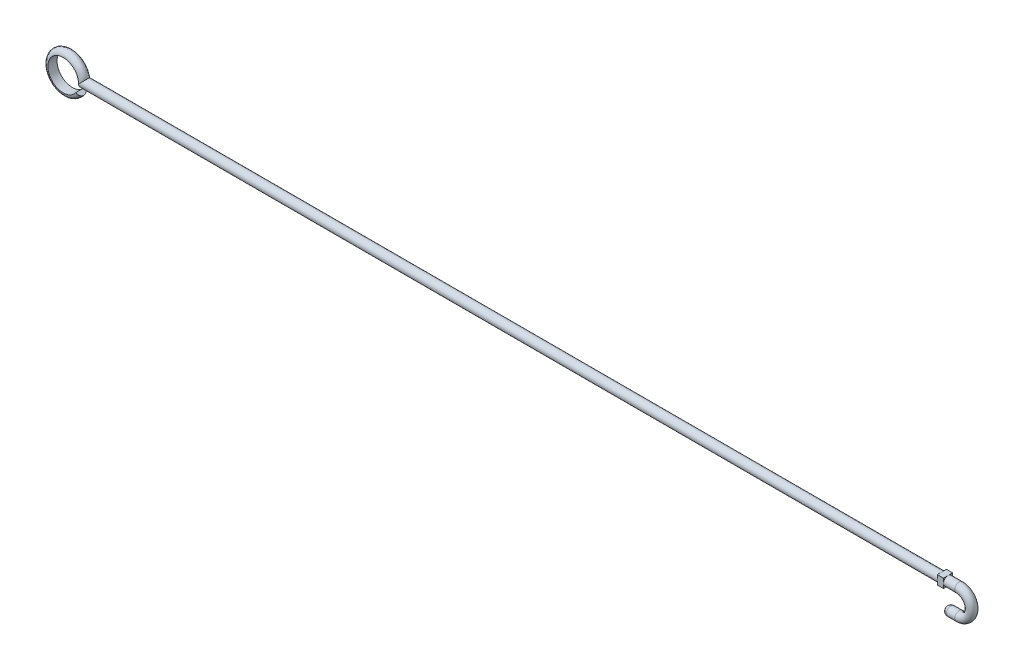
ISO-10303-21;
HEADER;
FILE_DESCRIPTION(('STEP AP214'),'2;1');
FILE_NAME('part.step','',(''),(''),'','','');
FILE_SCHEMA(('AUTOMOTIVE_DESIGN { 1 0 10303 214 1 1 1 1 }'));
ENDSEC;
DATA;
#1=APPLICATION_CONTEXT('core data for automotive mechanical design processes');
#2=APPLICATION_PROTOCOL_DEFINITION('international standard','automotive_design',2000,#1);
#3=PRODUCT_CONTEXT('',#1,'mechanical');
#4=PRODUCT('Part','Part','',(#3));
#5=PRODUCT_RELATED_PRODUCT_CATEGORY('part','',(#4));
#6=PRODUCT_DEFINITION_FORMATION('','',#4);
#7=PRODUCT_DEFINITION_CONTEXT('part definition',#1,'design');
#8=PRODUCT_DEFINITION('design','',#6,#7);
#9=PRODUCT_DEFINITION_SHAPE('','',#8);
#10=(LENGTH_UNIT() NAMED_UNIT(*) SI_UNIT(.MILLI.,.METRE.));
#11=(NAMED_UNIT(*) PLANE_ANGLE_UNIT() SI_UNIT($,.RADIAN.));
#12=(NAMED_UNIT(*) SI_UNIT($,.STERADIAN.) SOLID_ANGLE_UNIT());
#13=UNCERTAINTY_MEASURE_WITH_UNIT(LENGTH_MEASURE(1.E-05),#10,'distance_accuracy_value','');
#14=(GEOMETRIC_REPRESENTATION_CONTEXT(3) GLOBAL_UNCERTAINTY_ASSIGNED_CONTEXT((#13)) GLOBAL_UNIT_ASSIGNED_CONTEXT((#10,
#11,#12)) REPRESENTATION_CONTEXT('',''));
#15=CARTESIAN_POINT('',(0.,0.,0.));
#16=DIRECTION('',(0.,0.,1.));
#17=DIRECTION('',(1.,0.,0.));
#18=AXIS2_PLACEMENT_3D('',#15,#16,#17);
#19=CARTESIAN_POINT('',(1.,0.,0.));
#20=DIRECTION('',(1.,0.,0.));
#21=DIRECTION('',(0.,0.,-1.));
#22=AXIS2_PLACEMENT_3D('',#19,#20,#21);
#23=PLANE('',#22);
#24=CARTESIAN_POINT('',(1.,0.,0.));
#25=DIRECTION('',(1.,0.,0.));
#26=DIRECTION('',(0.,0.,-1.));
#27=AXIS2_PLACEMENT_3D('',#24,#25,#26);
#28=CIRCLE('',#27,0.735667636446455);
#29=CARTESIAN_POINT('',(1.,0.735667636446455,0.));
#30=VERTEX_POINT('',#29);
#31=CARTESIAN_POINT('',(1.,-0.735667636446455,0.));
#32=VERTEX_POINT('',#31);
#33=EDGE_CURVE('E166',#30,#32,#28,.T.);
#34=ORIENTED_EDGE('',*,*,#33,.F.);
#35=DIRECTION('',(0.,0.,1.));
#36=VECTOR('',#35,1.);
#37=CARTESIAN_POINT('',(1.,0.735667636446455,0.749999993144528));
#38=LINE('',#37,#36);
#39=CARTESIAN_POINT('',(1.,0.735667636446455,0.749999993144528));
#40=VERTEX_POINT('',#39);
#41=EDGE_CURVE('E154',#30,#40,#38,.T.);
#42=ORIENTED_EDGE('',*,*,#41,.T.);
#43=DIRECTION('',(0.,-1.,0.));
#44=VECTOR('',#43,1.);
#45=CARTESIAN_POINT('',(1.,0.735667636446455,0.749999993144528));
#46=LINE('',#45,#44);
#47=CARTESIAN_POINT('',(1.,-0.735667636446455,0.749999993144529));
#48=VERTEX_POINT('',#47);
#49=EDGE_CURVE('E153',#40,#48,#46,.T.);
#50=ORIENTED_EDGE('',*,*,#49,.T.);
#51=DIRECTION('',(0.,0.,-1.));
#52=VECTOR('',#51,1.);
#53=CARTESIAN_POINT('',(1.,-0.735667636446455,0.749999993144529));
#54=LINE('',#53,#52);
#55=EDGE_CURVE('E168',#48,#32,#54,.T.);
#56=ORIENTED_EDGE('',*,*,#55,.T.);
#57=EDGE_LOOP('',(#34,#42,#50,#56));
#58=FACE_BOUND('',#57,.T.);
#59=ADVANCED_FACE('F39',(#58),#23,.T.);
#60=CARTESIAN_POINT('',(0.,0.,0.));
#61=DIRECTION('',(1.,0.,0.));
#62=DIRECTION('',(0.,0.,-1.));
#63=AXIS2_PLACEMENT_3D('',#60,#61,#62);
#64=PLANE('',#63);
#65=DIRECTION('',(0.,0.,-1.));
#66=VECTOR('',#65,1.);
#67=CARTESIAN_POINT('',(0.,-0.735667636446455,0.749999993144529));
#68=LINE('',#67,#66);
#69=CARTESIAN_POINT('',(0.,-0.735667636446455,0.145921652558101));
#70=VERTEX_POINT('',#69);
#71=CARTESIAN_POINT('',(0.,-0.735667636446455,-0.145921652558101));
#72=VERTEX_POINT('',#71);
#73=EDGE_CURVE('E173',#70,#72,#68,.T.);
#74=ORIENTED_EDGE('',*,*,#73,.F.);
#75=CARTESIAN_POINT('',(0.,0.,0.));
#76=DIRECTION('',(1.,0.,0.));
#77=DIRECTION('',(0.,0.,-1.));
#78=AXIS2_PLACEMENT_3D('',#75,#76,#77);
#79=CIRCLE('',#78,0.75);
#80=EDGE_CURVE('E313',#70,#72,#79,.T.);
#81=ORIENTED_EDGE('',*,*,#80,.T.);
#82=EDGE_LOOP('',(#74,#81));
#83=FACE_BOUND('',#82,.T.);
#84=ADVANCED_FACE('F386',(#83),#64,.T.);
#85=DIRECTION('',(0.,0.,1.));
#86=VECTOR('',#85,1.);
#87=CARTESIAN_POINT('',(0.,0.735667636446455,0.749999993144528));
#88=LINE('',#87,#86);
#89=CARTESIAN_POINT('',(0.,0.735667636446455,-0.145921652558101));
#90=VERTEX_POINT('',#89);
#91=CARTESIAN_POINT('',(0.,0.735667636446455,0.145921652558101));
#92=VERTEX_POINT('',#91);
#93=EDGE_CURVE('E176',#90,#92,#88,.T.);
#94=ORIENTED_EDGE('',*,*,#93,.F.);
#95=EDGE_CURVE('E307',#90,#92,#79,.T.);
#96=ORIENTED_EDGE('',*,*,#95,.T.);
#97=EDGE_LOOP('',(#94,#96));
#98=FACE_BOUND('',#97,.T.);
#99=ADVANCED_FACE('F372',(#98),#64,.T.);
#100=CARTESIAN_POINT('',(-142.12132034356,0.,0.));
#101=DIRECTION('',(1.,0.,0.));
#102=DIRECTION('',(0.,1.,0.));
#103=AXIS2_PLACEMENT_3D('',#100,#101,#102);
#104=CYLINDRICAL_SURFACE('',#103,0.75);
#105=CARTESIAN_POINT('',(-140.,0.,-0.75));
#106=CARTESIAN_POINT('',(-139.999962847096,-0.041220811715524,-0.750040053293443));
#107=CARTESIAN_POINT('',(-140.001018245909,-0.0824119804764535,-0.746604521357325));
#108=CARTESIAN_POINT('',(-140.005032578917,-0.16349835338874,-0.733100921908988));
#109=CARTESIAN_POINT('',(-140.007986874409,-0.203396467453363,-0.723049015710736));
#110=CARTESIAN_POINT('',(-140.015519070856,-0.280862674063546,-0.696631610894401));
#111=CARTESIAN_POINT('',(-140.020096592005,-0.318431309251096,-0.680267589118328));
#112=CARTESIAN_POINT('',(-140.030388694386,-0.390302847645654,-0.641736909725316));
#113=CARTESIAN_POINT('',(-140.036103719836,-0.424604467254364,-0.619567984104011));
#114=CARTESIAN_POINT('',(-140.048245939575,-0.489935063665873,-0.569388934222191));
#115=CARTESIAN_POINT('',(-140.054687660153,-0.520857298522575,-0.541243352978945));
#116=CARTESIAN_POINT('',(-140.067470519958,-0.577623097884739,-0.480197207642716));
#117=CARTESIAN_POINT('',(-140.073811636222,-0.603465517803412,-0.447295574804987));
#118=CARTESIAN_POINT('',(-140.085829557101,-0.649900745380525,-0.376763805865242));
#119=CARTESIAN_POINT('',(-140.091488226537,-0.670362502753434,-0.339044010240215));
#120=CARTESIAN_POINT('',(-140.101282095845,-0.70460761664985,-0.260503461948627));
#121=CARTESIAN_POINT('',(-140.105417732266,-0.718392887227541,-0.219683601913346));
#122=CARTESIAN_POINT('',(-140.111545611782,-0.738508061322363,-0.137305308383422));
#123=CARTESIAN_POINT('',(-140.113594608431,-0.74503584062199,-0.0957995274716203));
#124=CARTESIAN_POINT('',(-140.115486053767,-0.751068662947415,-0.0122343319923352));
#125=CARTESIAN_POINT('',(-140.115328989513,-0.750575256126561,0.0298249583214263));
#126=CARTESIAN_POINT('',(-140.112876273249,-0.742734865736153,0.111692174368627));
#127=CARTESIAN_POINT('',(-140.110658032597,-0.735635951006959,0.151526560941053));
#128=CARTESIAN_POINT('',(-140.104458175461,-0.715186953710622,0.229410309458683));
#129=CARTESIAN_POINT('',(-140.100476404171,-0.701836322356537,0.267459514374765));
#130=CARTESIAN_POINT('',(-140.091136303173,-0.669080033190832,0.341300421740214));
#131=CARTESIAN_POINT('',(-140.085759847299,-0.649593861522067,0.377054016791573));
#132=CARTESIAN_POINT('',(-140.07424498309,-0.605175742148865,0.444866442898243));
#133=CARTESIAN_POINT('',(-140.068106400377,-0.580242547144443,0.476924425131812));
#134=CARTESIAN_POINT('',(-140.05544555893,-0.524409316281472,0.537840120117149));
#135=CARTESIAN_POINT('',(-140.048917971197,-0.493303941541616,0.566508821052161));
#136=CARTESIAN_POINT('',(-140.03643992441,-0.42663789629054,0.618272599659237));
#137=CARTESIAN_POINT('',(-140.030489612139,-0.391076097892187,0.641366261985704));
#138=CARTESIAN_POINT('',(-140.019780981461,-0.316157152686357,0.681441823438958));
#139=CARTESIAN_POINT('',(-140.015031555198,-0.276774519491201,0.698378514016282));
#140=CARTESIAN_POINT('',(-140.007328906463,-0.195565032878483,0.725312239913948));
#141=CARTESIAN_POINT('',(-140.0043730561,-0.153741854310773,0.735319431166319));
#142=CARTESIAN_POINT('',(-140.001659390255,-0.0929418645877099,0.744453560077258));
#143=CARTESIAN_POINT('',(-140.001038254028,-0.0744057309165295,0.746533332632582));
#144=CARTESIAN_POINT('',(-140.000208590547,-0.0372495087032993,0.749305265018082));
#145=CARTESIAN_POINT('',(-139.9999994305,-0.0186295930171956,0.749999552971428));
#146=CARTESIAN_POINT('',(-140.,0.,0.750000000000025));
#147=B_SPLINE_CURVE_WITH_KNOTS('',3,(#105,#106,#107,#108,#109,#110,#111,#112,#113,#114,#115,
#116,#117,#118,#119,#120,#121,#122,#123,#124,#125,#126,#127,#128,#129,#130,#131,#132,#133,#134,
#135,#136,#137,#138,#139,#140,#141,#142,#143,#144,#145,#146),.UNSPECIFIED.,.F.,.F.,(4,2,2,2,2,2,
2,2,2,2,2,2,2,2,2,2,2,2,2,2,4),(0.,0.123460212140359,0.246619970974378,0.369750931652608,
0.492930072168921,0.619274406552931,0.745647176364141,0.8748604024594,1.0040365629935,
1.12959708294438,1.25512988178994,1.37613073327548,1.49714220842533,1.61981293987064,
1.74251179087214,1.87032332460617,1.99816727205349,2.12693182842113,2.2555072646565,
2.3114487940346,2.36730433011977),.UNSPECIFIED.);
#148=CARTESIAN_POINT('',(-140.,0.,-0.750000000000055));
#149=VERTEX_POINT('',#148);
#150=CARTESIAN_POINT('',(-140.,3.01191363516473E-13,0.75));
#151=VERTEX_POINT('',#150);
#152=EDGE_CURVE('E325',#149,#151,#147,.T.);
#153=ORIENTED_EDGE('',*,*,#152,.F.);
#154=CARTESIAN_POINT('',(-139.25,0.749999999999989,0.));
#155=CARTESIAN_POINT('',(-139.25,0.749999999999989,1.5));
#156=CARTESIAN_POINT('',(-140.75,-0.750000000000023,1.5));
#157=CARTESIAN_POINT('',(-140.75,-0.750000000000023,0.));
#158=CARTESIAN_POINT('',(-140.75,-0.750000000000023,-1.5));
#159=CARTESIAN_POINT('',(-139.25,0.749999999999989,-1.5));
#160=CARTESIAN_POINT('',(-139.25,0.749999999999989,0.));
#161=(BOUNDED_CURVE() B_SPLINE_CURVE(3,(#154,#155,#156,#157,#158,#159,#160),.UNSPECIFIED.,.T.,
.F.) B_SPLINE_CURVE_WITH_KNOTS((4,3,4),(0.,0.5,1.),
.UNSPECIFIED.) CURVE() GEOMETRIC_REPRESENTATION_ITEM() RATIONAL_B_SPLINE_CURVE((1.,
0.333333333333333,0.333333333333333,1.,0.333333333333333,0.333333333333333,1.)) REPRESENTATION_ITEM(''));
#162=EDGE_CURVE('E320',#149,#151,#161,.T.);
#163=ORIENTED_EDGE('',*,*,#162,.T.);
#164=EDGE_LOOP('',(#153,#163));
#165=FACE_BOUND('',#164,.T.);
#166=CARTESIAN_POINT('',(0.,0.,-0.749999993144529));
#167=VERTEX_POINT('',#166);
#168=EDGE_CURVE('E305',#167,#90,#79,.T.);
#169=ORIENTED_EDGE('',*,*,#168,.F.);
#170=EDGE_CURVE('E62',#72,#167,#79,.T.);
#171=ORIENTED_EDGE('',*,*,#170,.F.);
#172=ORIENTED_EDGE('',*,*,#80,.F.);
#173=CARTESIAN_POINT('',(0.,0.,0.749999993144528));
#174=VERTEX_POINT('',#173);
#175=EDGE_CURVE('E318',#174,#70,#79,.T.);
#176=ORIENTED_EDGE('',*,*,#175,.F.);
#177=EDGE_CURVE('E311',#92,#174,#79,.T.);
#178=ORIENTED_EDGE('',*,*,#177,.F.);
#179=ORIENTED_EDGE('',*,*,#95,.F.);
#180=EDGE_LOOP('',(#169,#171,#172,#176,#178,#179));
#181=FACE_BOUND('',#180,.T.);
#182=ADVANCED_FACE('F369',(#165,#181),#104,.T.);
#183=CARTESIAN_POINT('',(-141.069484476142,-1.00803042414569,0.));
#184=DIRECTION('',(0.576017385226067,0.817437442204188,0.));
#185=DIRECTION('',(-0.817437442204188,0.576017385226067,0.));
#186=AXIS2_PLACEMENT_3D('',#183,#184,#185);
#187=PLANE('',#186);
#188=DIRECTION('',(0.,0.,1.));
#189=VECTOR('',#188,1.);
#190=CARTESIAN_POINT('',(-140.456406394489,-1.44004346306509,-0.750000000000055));
#191=LINE('',#190,#189);
#192=CARTESIAN_POINT('',(-140.456406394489,-1.44004346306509,0.750000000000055));
#193=VERTEX_POINT('',#192);
#194=CARTESIAN_POINT('',(-140.456406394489,-1.44004346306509,-0.750000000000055));
#195=VERTEX_POINT('',#194);
#196=EDGE_CURVE('E214',#193,#195,#191,.F.);
#197=ORIENTED_EDGE('',*,*,#196,.F.);
#198=CARTESIAN_POINT('',(-140.456406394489,-1.44004346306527,0.));
#199=DIRECTION('',(0.576017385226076,0.817437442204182,0.));
#200=DIRECTION('',(-0.817437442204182,0.576017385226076,0.));
#201=AXIS2_PLACEMENT_3D('',#198,#199,#200);
#202=CIRCLE('',#201,0.750000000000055);
#203=EDGE_CURVE('E314',#193,#195,#202,.T.);
#204=ORIENTED_EDGE('',*,*,#203,.T.);
#205=EDGE_LOOP('',(#197,#204));
#206=FACE_BOUND('',#205,.T.);
#207=ADVANCED_FACE('F371',(#206),#187,.T.);
#208=CARTESIAN_POINT('',(-139.25,0.749999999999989,0.));
#209=CARTESIAN_POINT('',(-139.25,0.863933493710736,0.));
#210=CARTESIAN_POINT('',(-139.384302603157,1.15590780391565,0.));
#211=CARTESIAN_POINT('',(-139.548199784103,1.5544134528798,0.));
#212=CARTESIAN_POINT('',(-139.8257318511,1.97562155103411,0.));
#213=CARTESIAN_POINT('',(-140.178911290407,2.38424701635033,0.));
#214=CARTESIAN_POINT('',(-140.662019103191,2.75100060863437,0.));
#215=CARTESIAN_POINT('',(-141.204137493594,3.04552854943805,0.));
#216=CARTESIAN_POINT('',(-141.821593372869,3.24686996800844,0.));
#217=CARTESIAN_POINT('',(-142.498103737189,3.31413559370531,0.));
#218=CARTESIAN_POINT('',(-143.172756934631,3.22854519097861,0.));
#219=CARTESIAN_POINT('',(-143.789387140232,3.02870066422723,0.));
#220=CARTESIAN_POINT('',(-144.33633461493,2.74027514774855,0.));
#221=CARTESIAN_POINT('',(-144.802064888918,2.35184343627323,0.));
#222=CARTESIAN_POINT('',(-145.153623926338,1.93912991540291,0.));
#223=CARTESIAN_POINT('',(-145.412637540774,1.51039568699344,0.));
#224=CARTESIAN_POINT('',(-145.58821840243,1.09387031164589,0.));
#225=CARTESIAN_POINT('',(-145.700183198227,0.68770001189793,0.));
#226=CARTESIAN_POINT('',(-145.760926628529,0.270641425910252,0.));
#227=CARTESIAN_POINT('',(-145.768440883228,-0.181707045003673,0.));
#228=CARTESIAN_POINT('',(-145.701672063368,-0.678445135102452,0.));
#229=CARTESIAN_POINT('',(-145.549350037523,-1.19914523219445,0.));
#230=CARTESIAN_POINT('',(-145.268167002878,-1.73808907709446,0.));
#231=CARTESIAN_POINT('',(-144.891264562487,-2.22664805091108,0.));
#232=CARTESIAN_POINT('',(-144.409331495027,-2.66089170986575,0.));
#233=CARTESIAN_POINT('',(-143.820848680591,-3.00170148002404,0.));
#234=CARTESIAN_POINT('',(-143.170456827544,-3.2005010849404,0.));
#235=CARTESIAN_POINT('',(-142.525152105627,-3.26325280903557,0.));
#236=CARTESIAN_POINT('',(-141.909774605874,-3.21403985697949,0.));
#237=CARTESIAN_POINT('',(-141.324066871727,-3.049434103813,0.));
#238=CARTESIAN_POINT('',(-140.838546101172,-2.81080050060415,0.));
#239=CARTESIAN_POINT('',(-140.425654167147,-2.51652681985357,0.));
#240=CARTESIAN_POINT('',(-140.108819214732,-2.21760534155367,0.));
#241=CARTESIAN_POINT('',(-139.906250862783,-1.96135111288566,0.));
#242=CARTESIAN_POINT('',(-139.843328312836,-1.87205650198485,0.));
#243=CARTESIAN_POINT('',(-139.25,0.749999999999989,1.5));
#244=CARTESIAN_POINT('',(-139.25,0.804461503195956,1.5));
#245=CARTESIAN_POINT('',(-139.384302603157,1.18642721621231,1.5));
#246=CARTESIAN_POINT('',(-139.548199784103,1.54505988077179,1.50000000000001));
#247=CARTESIAN_POINT('',(-139.8257318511,1.97846441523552,1.49999999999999));
#248=CARTESIAN_POINT('',(-140.178911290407,2.38337551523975,1.50000000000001));
#249=CARTESIAN_POINT('',(-140.662019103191,2.75125606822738,1.50000000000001));
#250=CARTESIAN_POINT('',(-141.204137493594,3.0454560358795,1.50000000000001));
#251=CARTESIAN_POINT('',(-141.821593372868,3.24689028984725,1.49999999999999));
#252=CARTESIAN_POINT('',(-142.498103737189,3.31413009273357,1.50000000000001));
#253=CARTESIAN_POINT('',(-143.172756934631,3.22854661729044,1.50000000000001));
#254=CARTESIAN_POINT('',(-143.789387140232,3.02870030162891,1.50000000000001));
#255=CARTESIAN_POINT('',(-144.33633461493,2.7402752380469,1.5));
#256=CARTESIAN_POINT('',(-144.802064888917,2.35184341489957,1.49999999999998));
#257=CARTESIAN_POINT('',(-145.15362392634,1.93912992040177,1.50000000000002));
#258=CARTESIAN_POINT('',(-145.412637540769,1.51039568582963,1.5));
#259=CARTESIAN_POINT('',(-145.588218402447,1.09387031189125,1.5));
#260=CARTESIAN_POINT('',(-145.700183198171,0.68770001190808,1.5));
#261=CARTESIAN_POINT('',(-145.760926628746,0.27064142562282,1.5));
#262=CARTESIAN_POINT('',(-145.768440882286,-0.181707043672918,1.5));
#263=CARTESIAN_POINT('',(-145.70167206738,-0.678445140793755,1.5));
#264=CARTESIAN_POINT('',(-145.549350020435,-1.19914520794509,1.5));
#265=CARTESIAN_POINT('',(-145.268167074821,-1.73808917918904,1.5));
#266=CARTESIAN_POINT('',(-144.89126427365,-2.22664764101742,1.5));
#267=CARTESIAN_POINT('',(-144.409332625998,-2.6608933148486,1.5));
#268=CARTESIAN_POINT('',(-143.820844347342,-3.00169533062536,1.5));
#269=CARTESIAN_POINT('',(-143.170472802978,-3.20052375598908,1.5));
#270=CARTESIAN_POINT('',(-142.525095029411,-3.26317181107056,1.5));
#271=CARTESIAN_POINT('',(-141.909974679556,-3.21432378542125,1.5));
#272=CARTESIAN_POINT('',(-141.323390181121,-3.04847379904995,1.5));
#273=CARTESIAN_POINT('',(-140.840754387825,-2.81393432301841,1.5));
#274=CARTESIAN_POINT('',(-140.418419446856,-2.5062598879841,1.5));
#275=CARTESIAN_POINT('',(-140.132369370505,-2.25102582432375,1.5));
#276=CARTESIAN_POINT('',(-139.860456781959,-1.89636384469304,1.5));
#277=CARTESIAN_POINT('',(-139.843328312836,-1.87205650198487,1.5));
#278=CARTESIAN_POINT('',(-140.75,-0.750000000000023,1.5));
#279=CARTESIAN_POINT('',(-140.75,-0.695538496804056,1.5));
#280=CARTESIAN_POINT('',(-140.645970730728,-0.451659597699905,1.5));
#281=CARTESIAN_POINT('',(-140.628139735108,-0.171423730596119,1.49999999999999));
#282=CARTESIAN_POINT('',(-140.626999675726,0.162013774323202,1.50000000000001));
#283=CARTESIAN_POINT('',(-140.708974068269,0.510115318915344,1.49999999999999));
#284=CARTESIAN_POINT('',(-140.833933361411,0.847272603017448,1.49999999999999));
#285=CARTESIAN_POINT('',(-141.082646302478,1.17569642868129,1.49999999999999));
#286=CARTESIAN_POINT('',(-141.389922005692,1.45326834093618,1.50000000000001));
#287=CARTESIAN_POINT('',(-141.730107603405,1.66777908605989,1.49999999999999));
#288=CARTESIAN_POINT('',(-142.110660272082,1.79245900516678,1.49999999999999));
#289=CARTESIAN_POINT('',(-142.520431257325,1.81527217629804,1.49999999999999));
#290=CARTESIAN_POINT('',(-142.913702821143,1.74991844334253,1.5));
#291=CARTESIAN_POINT('',(-143.242948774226,1.6505749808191,1.50000000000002));
#292=CARTESIAN_POINT('',(-143.534664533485,1.47160613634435,1.49999999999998));
#293=CARTESIAN_POINT('',(-143.764874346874,1.27364783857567,1.5));
#294=CARTESIAN_POINT('',(-143.943742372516,1.05552835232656,1.5));
#295=CARTESIAN_POINT('',(-144.079818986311,0.827568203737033,1.5));
#296=CARTESIAN_POINT('',(-144.181647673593,0.583436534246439,1.5));
#297=CARTESIAN_POINT('',(-144.250061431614,0.313042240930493,1.5));
#298=CARTESIAN_POINT('',(-144.277953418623,0.0154965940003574,1.5));
#299=CARTESIAN_POINT('',(-144.245815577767,-0.31684329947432,1.5));
#300=CARTESIAN_POINT('',(-144.157261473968,-0.636913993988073,1.5));
#301=CARTESIAN_POINT('',(-143.970285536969,-0.977527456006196,1.5));
#302=CARTESIAN_POINT('',(-143.716732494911,-1.27840804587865,1.5));
#303=CARTESIAN_POINT('',(-143.41929634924,-1.51473400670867,1.5));
#304=CARTESIAN_POINT('',(-143.073914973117,-1.67211390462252,1.5));
#305=CARTESIAN_POINT('',(-142.688773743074,-1.74987492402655,1.5));
#306=CARTESIAN_POINT('',(-142.303598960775,-1.74668792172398,1.5));
#307=CARTESIAN_POINT('',(-141.980087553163,-1.68440380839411,1.5));
#308=CARTESIAN_POINT('',(-141.678109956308,-1.5578984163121,1.5));
#309=CARTESIAN_POINT('',(-141.42547693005,-1.38891339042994,1.5));
#310=CARTESIAN_POINT('',(-141.243764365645,-1.23379299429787,1.5));
#311=CARTESIAN_POINT('',(-141.086612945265,-1.03233776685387,1.5));
#312=CARTESIAN_POINT('',(-141.069484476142,-1.0080304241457,1.5));
#313=CARTESIAN_POINT('',(-140.75,-0.750000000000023,0.));
#314=CARTESIAN_POINT('',(-140.75,-0.665802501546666,0.));
#315=CARTESIAN_POINT('',(-140.645970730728,-0.466919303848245,0.));
#316=CARTESIAN_POINT('',(-140.628139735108,-0.166746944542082,0.));
#317=CARTESIAN_POINT('',(-140.626999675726,0.160592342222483,0.));
#318=CARTESIAN_POINT('',(-140.708974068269,0.510551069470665,0.));
#319=CARTESIAN_POINT('',(-140.833933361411,0.847144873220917,0.));
#320=CARTESIAN_POINT('',(-141.082646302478,1.17573268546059,0.));
#321=CARTESIAN_POINT('',(-141.389922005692,1.45325818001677,0.));
#322=CARTESIAN_POINT('',(-141.730107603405,1.66778183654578,0.));
#323=CARTESIAN_POINT('',(-142.110660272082,1.79245829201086,0.));
#324=CARTESIAN_POINT('',(-142.520431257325,1.81527235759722,0.));
#325=CARTESIAN_POINT('',(-142.913702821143,1.74991839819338,0.));
#326=CARTESIAN_POINT('',(-143.242948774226,1.65057499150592,0.));
#327=CARTESIAN_POINT('',(-143.534664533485,1.47160613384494,0.));
#328=CARTESIAN_POINT('',(-143.764874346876,1.27364783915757,0.));
#329=CARTESIAN_POINT('',(-143.943742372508,1.05552835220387,0.));
#330=CARTESIAN_POINT('',(-144.079818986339,0.827568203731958,0.));
#331=CARTESIAN_POINT('',(-144.181647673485,0.583436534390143,0.));
#332=CARTESIAN_POINT('',(-144.250061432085,0.313042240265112,0.));
#333=CARTESIAN_POINT('',(-144.277953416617,0.0154965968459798,0.));
#334=CARTESIAN_POINT('',(-144.245815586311,-0.316843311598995,0.));
#335=CARTESIAN_POINT('',(-144.157261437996,-0.636913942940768,0.));
#336=CARTESIAN_POINT('',(-143.970285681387,-0.977527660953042,0.));
#337=CARTESIAN_POINT('',(-143.716731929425,-1.27840724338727,0.));
#338=CARTESIAN_POINT('',(-143.419298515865,-1.51473708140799,0.));
#339=CARTESIAN_POINT('',(-143.0739069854,-1.67210256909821,0.));
#340=CARTESIAN_POINT('',(-142.688802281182,-1.74991542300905,0.));
#341=CARTESIAN_POINT('',(-142.303498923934,-1.74654595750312,0.));
#342=CARTESIAN_POINT('',(-141.980425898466,-1.68488396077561,0.));
#343=CARTESIAN_POINT('',(-141.677005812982,-1.55633150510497,0.));
#344=CARTESIAN_POINT('',(-141.429094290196,-1.39404685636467,0.));
#345=CARTESIAN_POINT('',(-141.231989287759,-1.21708275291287,0.));
#346=CARTESIAN_POINT('',(-141.109509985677,-1.06483140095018,0.));
#347=CARTESIAN_POINT('',(-141.069484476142,-1.00803042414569,0.));
#348=CARTESIAN_POINT('',(-140.75,-0.750000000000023,-1.5));
#349=CARTESIAN_POINT('',(-140.75,-0.636066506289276,-1.5));
#350=CARTESIAN_POINT('',(-140.645970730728,-0.482179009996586,-1.5));
#351=CARTESIAN_POINT('',(-140.628139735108,-0.16207015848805,-1.50000000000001));
#352=CARTESIAN_POINT('',(-140.626999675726,0.159170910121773,-1.49999999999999));
#353=CARTESIAN_POINT('',(-140.708974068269,0.510986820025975,-1.50000000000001));
#354=CARTESIAN_POINT('',(-140.833933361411,0.84701714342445,-1.50000000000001));
#355=CARTESIAN_POINT('',(-141.082646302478,1.17576894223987,-1.50000000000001));
#356=CARTESIAN_POINT('',(-141.389922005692,1.45324801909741,-1.49999999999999));
#357=CARTESIAN_POINT('',(-141.730107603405,1.66778458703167,-1.50000000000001));
#358=CARTESIAN_POINT('',(-142.110660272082,1.79245757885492,-1.50000000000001));
#359=CARTESIAN_POINT('',(-142.520431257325,1.8152725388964,-1.50000000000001));
#360=CARTESIAN_POINT('',(-142.913702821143,1.74991835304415,-1.5));
#361=CARTESIAN_POINT('',(-143.242948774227,1.65057500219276,-1.49999999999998));
#362=CARTESIAN_POINT('',(-143.534664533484,1.47160613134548,-1.50000000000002));
#363=CARTESIAN_POINT('',(-143.764874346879,1.27364783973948,-1.5));
#364=CARTESIAN_POINT('',(-143.943742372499,1.05552835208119,-1.5));
#365=CARTESIAN_POINT('',(-144.079818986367,0.827568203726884,-1.5));
#366=CARTESIAN_POINT('',(-144.181647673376,0.58343653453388,-1.5));
#367=CARTESIAN_POINT('',(-144.250061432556,0.31304223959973,-1.5));
#368=CARTESIAN_POINT('',(-144.277953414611,0.0154965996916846,-1.5));
#369=CARTESIAN_POINT('',(-144.245815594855,-0.316843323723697,-1.5));
#370=CARTESIAN_POINT('',(-144.157261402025,-0.636913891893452,-1.5));
#371=CARTESIAN_POINT('',(-143.970285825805,-0.97752786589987,-1.5));
#372=CARTESIAN_POINT('',(-143.71673136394,-1.27840644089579,-1.5));
#373=CARTESIAN_POINT('',(-143.41930068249,-1.51474015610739,-1.5));
#374=CARTESIAN_POINT('',(-143.073898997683,-1.67209123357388,-1.5));
#375=CARTESIAN_POINT('',(-142.68883081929,-1.74995592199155,-1.5));
#376=CARTESIAN_POINT('',(-142.303398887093,-1.74640399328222,-1.5));
#377=CARTESIAN_POINT('',(-141.980764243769,-1.68536411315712,-1.5));
#378=CARTESIAN_POINT('',(-141.675901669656,-1.55476459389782,-1.5));
#379=CARTESIAN_POINT('',(-141.432711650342,-1.39918032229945,-1.5));
#380=CARTESIAN_POINT('',(-141.220214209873,-1.2003725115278,-1.5));
#381=CARTESIAN_POINT('',(-141.13240702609,-1.09732503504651,-1.5));
#382=CARTESIAN_POINT('',(-141.069484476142,-1.0080304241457,-1.5));
#383=CARTESIAN_POINT('',(-139.25,0.749999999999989,-1.5));
#384=CARTESIAN_POINT('',(-139.25,0.923405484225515,-1.5));
#385=CARTESIAN_POINT('',(-139.384302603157,1.12538839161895,-1.5));
#386=CARTESIAN_POINT('',(-139.548199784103,1.56376702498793,-1.49999999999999));
#387=CARTESIAN_POINT('',(-139.8257318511,1.97277868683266,-1.50000000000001));
#388=CARTESIAN_POINT('',(-140.178911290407,2.38511851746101,-1.49999999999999));
#389=CARTESIAN_POINT('',(-140.662019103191,2.75074514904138,-1.49999999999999));
#390=CARTESIAN_POINT('',(-141.204137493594,3.04560106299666,-1.49999999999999));
#391=CARTESIAN_POINT('',(-141.821593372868,3.2468496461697,-1.50000000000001));
#392=CARTESIAN_POINT('',(-142.498103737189,3.31414109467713,-1.49999999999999));
#393=CARTESIAN_POINT('',(-143.172756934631,3.22854376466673,-1.49999999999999));
#394=CARTESIAN_POINT('',(-143.789387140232,3.02870102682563,-1.49999999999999));
#395=CARTESIAN_POINT('',(-144.33633461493,2.74027505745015,-1.5));
#396=CARTESIAN_POINT('',(-144.802064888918,2.35184345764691,-1.50000000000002));
#397=CARTESIAN_POINT('',(-145.153623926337,1.93912991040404,-1.49999999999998));
#398=CARTESIAN_POINT('',(-145.412637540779,1.51039568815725,-1.5));
#399=CARTESIAN_POINT('',(-145.588218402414,1.09387031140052,-1.5));
#400=CARTESIAN_POINT('',(-145.700183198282,0.687700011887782,-1.5));
#401=CARTESIAN_POINT('',(-145.760926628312,0.270641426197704,-1.5));
#402=CARTESIAN_POINT('',(-145.76844088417,-0.181707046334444,-1.5));
#403=CARTESIAN_POINT('',(-145.701672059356,-0.678445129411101,-1.5));
#404=CARTESIAN_POINT('',(-145.549350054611,-1.19914525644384,-1.5));
#405=CARTESIAN_POINT('',(-145.268166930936,-1.7380889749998,-1.5));
#406=CARTESIAN_POINT('',(-144.891264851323,-2.22664846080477,-1.5));
#407=CARTESIAN_POINT('',(-144.409330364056,-2.66089010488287,-1.5));
#408=CARTESIAN_POINT('',(-143.820853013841,-3.0017076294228,-1.5));
#409=CARTESIAN_POINT('',(-143.170440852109,-3.20047841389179,-1.5));
#410=CARTESIAN_POINT('',(-142.525209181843,-3.26333380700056,-1.5));
#411=CARTESIAN_POINT('',(-141.909574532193,-3.21375592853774,-1.5));
#412=CARTESIAN_POINT('',(-141.324743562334,-3.05039440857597,-1.5));
#413=CARTESIAN_POINT('',(-140.83633781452,-2.80766667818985,-1.5));
#414=CARTESIAN_POINT('',(-140.432888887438,-2.52679375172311,-1.5));
#415=CARTESIAN_POINT('',(-140.08526905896,-2.18418485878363,-1.5));
#416=CARTESIAN_POINT('',(-139.952044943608,-2.02633838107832,-1.5));
#417=CARTESIAN_POINT('',(-139.843328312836,-1.87205650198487,-1.5));
#418=CARTESIAN_POINT('',(-139.25,0.749999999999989,0.));
#419=CARTESIAN_POINT('',(-139.25,0.863933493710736,0.));
#420=CARTESIAN_POINT('',(-139.384302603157,1.15590780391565,0.));
#421=CARTESIAN_POINT('',(-139.548199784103,1.5544134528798,0.));
#422=CARTESIAN_POINT('',(-139.8257318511,1.97562155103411,0.));
#423=CARTESIAN_POINT('',(-140.178911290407,2.38424701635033,0.));
#424=CARTESIAN_POINT('',(-140.662019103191,2.75100060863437,0.));
#425=CARTESIAN_POINT('',(-141.204137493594,3.04552854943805,0.));
#426=CARTESIAN_POINT('',(-141.821593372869,3.24686996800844,0.));
#427=CARTESIAN_POINT('',(-142.498103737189,3.31413559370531,0.));
#428=CARTESIAN_POINT('',(-143.172756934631,3.22854519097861,0.));
#429=CARTESIAN_POINT('',(-143.789387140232,3.02870066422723,0.));
#430=CARTESIAN_POINT('',(-144.33633461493,2.74027514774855,0.));
#431=CARTESIAN_POINT('',(-144.802064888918,2.35184343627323,0.));
#432=CARTESIAN_POINT('',(-145.153623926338,1.93912991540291,0.));
#433=CARTESIAN_POINT('',(-145.412637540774,1.51039568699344,0.));
#434=CARTESIAN_POINT('',(-145.58821840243,1.09387031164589,0.));
#435=CARTESIAN_POINT('',(-145.700183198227,0.68770001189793,0.));
#436=CARTESIAN_POINT('',(-145.760926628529,0.270641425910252,0.));
#437=CARTESIAN_POINT('',(-145.768440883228,-0.181707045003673,0.));
#438=CARTESIAN_POINT('',(-145.701672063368,-0.678445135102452,0.));
#439=CARTESIAN_POINT('',(-145.549350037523,-1.19914523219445,0.));
#440=CARTESIAN_POINT('',(-145.268167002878,-1.73808907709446,0.));
#441=CARTESIAN_POINT('',(-144.891264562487,-2.22664805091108,0.));
#442=CARTESIAN_POINT('',(-144.409331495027,-2.66089170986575,0.));
#443=CARTESIAN_POINT('',(-143.820848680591,-3.00170148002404,0.));
#444=CARTESIAN_POINT('',(-143.170456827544,-3.2005010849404,0.));
#445=CARTESIAN_POINT('',(-142.525152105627,-3.26325280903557,0.));
#446=CARTESIAN_POINT('',(-141.909774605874,-3.21403985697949,0.));
#447=CARTESIAN_POINT('',(-141.324066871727,-3.049434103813,0.));
#448=CARTESIAN_POINT('',(-140.838546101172,-2.81080050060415,0.));
#449=CARTESIAN_POINT('',(-140.425654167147,-2.51652681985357,0.));
#450=CARTESIAN_POINT('',(-140.108819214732,-2.21760534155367,0.));
#451=CARTESIAN_POINT('',(-139.906250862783,-1.96135111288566,0.));
#452=CARTESIAN_POINT('',(-139.843328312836,-1.87205650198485,0.));
#453=(BOUNDED_SURFACE() B_SPLINE_SURFACE(3,3,((#208,#209,#210,#211,#212,#213,#214,#215,#216,
#217,#218,#219,#220,#221,#222,#223,#224,#225,#226,#227,#228,#229,#230,#231,#232,#233,#234,#235,
#236,#237,#238,#239,#240,#241,#242),(#243,#244,#245,#246,#247,#248,#249,#250,#251,#252,#253,
#254,#255,#256,#257,#258,#259,#260,#261,#262,#263,#264,#265,#266,#267,#268,#269,#270,#271,#272,
#273,#274,#275,#276,#277),(#278,#279,#280,#281,#282,#283,#284,#285,#286,#287,#288,#289,#290,
#291,#292,#293,#294,#295,#296,#297,#298,#299,#300,#301,#302,#303,#304,#305,#306,#307,#308,#309,
#310,#311,#312),(#313,#314,#315,#316,#317,#318,#319,#320,#321,#322,#323,#324,#325,#326,#327,
#328,#329,#330,#331,#332,#333,#334,#335,#336,#337,#338,#339,#340,#341,#342,#343,#344,#345,#346,
#347),(#348,#349,#350,#351,#352,#353,#354,#355,#356,#357,#358,#359,#360,#361,#362,#363,#364,
#365,#366,#367,#368,#369,#370,#371,#372,#373,#374,#375,#376,#377,#378,#379,#380,#381,#382),
(#383,#384,#385,#386,#387,#388,#389,#390,#391,#392,#393,#394,#395,#396,#397,#398,#399,#400,#401,
#402,#403,#404,#405,#406,#407,#408,#409,#410,#411,#412,#413,#414,#415,#416,#417),(#418,#419,
#420,#421,#422,#423,#424,#425,#426,#427,#428,#429,#430,#431,#432,#433,#434,#435,#436,#437,#438,
#439,#440,#441,#442,#443,#444,#445,#446,#447,#448,#449,#450,#451,#452)),.UNSPECIFIED.,.T.,.F.,
.F.) B_SPLINE_SURFACE_WITH_KNOTS((4,3,4),(4,1,1,1,1,1,1,1,1,1,1,1,1,1,1,1,1,1,1,1,1,1,1,1,1,1,1,
1,1,1,1,1,4),(0.,0.5,1.),(0.,0.0236447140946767,0.0497703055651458,0.07826532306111,
0.109258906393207,0.143222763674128,0.178859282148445,0.215752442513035,0.25366266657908,
0.291493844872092,0.328206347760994,0.36356454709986,0.397052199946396,0.427559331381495,
0.455491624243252,0.4810285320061,0.504067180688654,0.527086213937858,0.55255645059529,
0.580360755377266,0.610674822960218,0.643838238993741,0.678874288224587,0.715173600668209,
0.752392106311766,0.789592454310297,0.82585160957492,0.860826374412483,0.893884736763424,
0.924091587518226,0.951771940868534,0.977113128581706,1.),
.UNSPECIFIED.) GEOMETRIC_REPRESENTATION_ITEM() RATIONAL_B_SPLINE_SURFACE(((1.,1.,1.,1.,1.,1.,1.,
1.,1.,1.,1.,1.,1.,1.,1.,1.,1.,1.,1.,1.,1.,1.,1.,1.,1.,1.,1.,1.,1.,1.,1.,1.,1.,1.,1.),
(0.333333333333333,0.333333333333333,0.333333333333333,0.333333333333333,0.333333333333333,
0.333333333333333,0.333333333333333,0.333333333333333,0.333333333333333,0.333333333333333,
0.333333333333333,0.333333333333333,0.333333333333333,0.333333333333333,0.333333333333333,
0.333333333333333,0.333333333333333,0.333333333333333,0.333333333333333,0.333333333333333,
0.333333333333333,0.333333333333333,0.333333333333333,0.333333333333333,0.333333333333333,
0.333333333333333,0.333333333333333,0.333333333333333,0.333333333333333,0.333333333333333,
0.333333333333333,0.333333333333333,0.333333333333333,0.333333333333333,0.333333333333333),
(0.333333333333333,0.333333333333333,0.333333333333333,0.333333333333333,0.333333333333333,
0.333333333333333,0.333333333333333,0.333333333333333,0.333333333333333,0.333333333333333,
0.333333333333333,0.333333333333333,0.333333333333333,0.333333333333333,0.333333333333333,
0.333333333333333,0.333333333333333,0.333333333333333,0.333333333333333,0.333333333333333,
0.333333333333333,0.333333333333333,0.333333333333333,0.333333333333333,0.333333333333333,
0.333333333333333,0.333333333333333,0.333333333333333,0.333333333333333,0.333333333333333,
0.333333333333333,0.333333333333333,0.333333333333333,0.333333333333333,0.333333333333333),(1.,
1.,1.,1.,1.,1.,1.,1.,1.,1.,1.,1.,1.,1.,1.,1.,1.,1.,1.,1.,1.,1.,1.,1.,1.,1.,1.,1.,1.,1.,1.,1.,1.,
1.,1.),(0.333333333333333,0.333333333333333,0.333333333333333,0.333333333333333,
0.333333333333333,0.333333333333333,0.333333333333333,0.333333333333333,0.333333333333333,
0.333333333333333,0.333333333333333,0.333333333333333,0.333333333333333,0.333333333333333,
0.333333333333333,0.333333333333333,0.333333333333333,0.333333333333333,0.333333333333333,
0.333333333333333,0.333333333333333,0.333333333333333,0.333333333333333,0.333333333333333,
0.333333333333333,0.333333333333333,0.333333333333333,0.333333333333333,0.333333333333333,
0.333333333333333,0.333333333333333,0.333333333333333,0.333333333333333,0.333333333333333,
0.333333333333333),(0.333333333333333,0.333333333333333,0.333333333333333,0.333333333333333,
0.333333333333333,0.333333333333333,0.333333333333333,0.333333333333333,0.333333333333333,
0.333333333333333,0.333333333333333,0.333333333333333,0.333333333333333,0.333333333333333,
0.333333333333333,0.333333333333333,0.333333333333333,0.333333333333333,0.333333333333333,
0.333333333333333,0.333333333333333,0.333333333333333,0.333333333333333,0.333333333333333,
0.333333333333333,0.333333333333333,0.333333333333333,0.333333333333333,0.333333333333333,
0.333333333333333,0.333333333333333,0.333333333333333,0.333333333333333,0.333333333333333,
0.333333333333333),(1.,1.,1.,1.,1.,1.,1.,1.,1.,1.,1.,1.,1.,1.,1.,1.,1.,1.,1.,1.,1.,1.,1.,1.,1.,
1.,1.,1.,1.,1.,1.,1.,1.,1.,1.))) REPRESENTATION_ITEM('') SURFACE());
#454=CARTESIAN_POINT('',(-140.,0.,-0.75));
#455=CARTESIAN_POINT('',(-140.000000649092,0.0617988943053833,-0.749999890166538));
#456=CARTESIAN_POINT('',(-140.002292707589,0.123573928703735,-0.749999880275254));
#457=CARTESIAN_POINT('',(-140.011448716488,0.246865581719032,-0.749999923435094));
#458=CARTESIAN_POINT('',(-140.018318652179,0.308381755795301,-0.74999997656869));
#459=CARTESIAN_POINT('',(-140.045944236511,0.493148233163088,-0.750000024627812));
#460=CARTESIAN_POINT('',(-140.073715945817,0.615425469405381,-0.749999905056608));
#461=CARTESIAN_POINT('',(-140.147241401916,0.854523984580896,-0.749999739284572));
#462=CARTESIAN_POINT('',(-140.193014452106,0.971339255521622,-0.749999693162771));
#463=CARTESIAN_POINT('',(-140.30823149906,1.21073398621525,-0.750000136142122));
#464=CARTESIAN_POINT('',(-140.37989494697,1.33225435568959,-0.750000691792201));
#465=CARTESIAN_POINT('',(-140.542608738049,1.56153620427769,-0.749999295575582));
#466=CARTESIAN_POINT('',(-140.633661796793,1.66929575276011,-0.749997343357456));
#467=CARTESIAN_POINT('',(-140.832565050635,1.86799803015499,-0.749982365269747));
#468=CARTESIAN_POINT('',(-140.940414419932,1.95894158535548,-0.749969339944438));
#469=CARTESIAN_POINT('',(-141.169845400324,2.12142625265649,-0.749963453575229));
#470=CARTESIAN_POINT('',(-141.291426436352,2.19296817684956,-0.749970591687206));
#471=CARTESIAN_POINT('',(-141.544875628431,2.31462666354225,-0.749986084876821));
#472=CARTESIAN_POINT('',(-141.676743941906,2.36474289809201,-0.749994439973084));
#473=CARTESIAN_POINT('',(-141.947024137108,2.4421256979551,-0.750001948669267));
#474=CARTESIAN_POINT('',(-142.085436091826,2.46939200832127,-0.750001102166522));
#475=CARTESIAN_POINT('',(-142.364872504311,2.5003000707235,-0.749998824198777));
#476=CARTESIAN_POINT('',(-142.505896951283,2.50394192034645,-0.749997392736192));
#477=CARTESIAN_POINT('',(-142.786555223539,2.4874979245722,-0.749983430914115));
#478=CARTESIAN_POINT('',(-142.92618905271,2.4674121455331,-0.749970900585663));
#479=CARTESIAN_POINT('',(-143.200102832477,2.40408316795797,-0.749963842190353));
#480=CARTESIAN_POINT('',(-143.334382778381,2.36083994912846,-0.749969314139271));
#481=CARTESIAN_POINT('',(-143.593776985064,2.25242352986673,-0.749984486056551));
#482=CARTESIAN_POINT('',(-143.718891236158,2.18725030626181,-0.74999418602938));
#483=CARTESIAN_POINT('',(-143.956402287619,2.03682409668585,-0.750002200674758));
#484=CARTESIAN_POINT('',(-144.068799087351,1.95157110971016,-0.750000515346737));
#485=CARTESIAN_POINT('',(-144.27768443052,1.76340507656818,-0.749999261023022));
#486=CARTESIAN_POINT('',(-144.374172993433,1.66049205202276,-0.749999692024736));
#487=CARTESIAN_POINT('',(-144.548503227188,1.43992909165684,-0.750000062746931));
#488=CARTESIAN_POINT('',(-144.626344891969,1.32227915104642,-0.750000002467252));
#489=CARTESIAN_POINT('',(-144.761170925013,1.07557508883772,-0.749999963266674));
#490=CARTESIAN_POINT('',(-144.818155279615,0.946520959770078,-0.749999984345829));
#491=CARTESIAN_POINT('',(-144.909651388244,0.680698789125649,-0.750000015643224));
#492=CARTESIAN_POINT('',(-144.944163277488,0.543930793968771,-0.75000002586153));
#493=CARTESIAN_POINT('',(-144.989725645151,0.266464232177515,-0.74999997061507));
#494=CARTESIAN_POINT('',(-145.000775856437,0.125765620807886,-0.749999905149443));
#495=CARTESIAN_POINT('',(-144.999546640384,-0.085036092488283,-0.749999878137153));
#496=CARTESIAN_POINT('',(-144.996163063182,-0.155298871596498,-0.749999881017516));
#497=CARTESIAN_POINT('',(-144.983492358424,-0.295291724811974,-0.749999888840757));
#498=CARTESIAN_POINT('',(-144.974206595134,-0.365021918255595,-0.749999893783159));
#499=CARTESIAN_POINT('',(-144.949796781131,-0.503419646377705,-0.749999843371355));
#500=CARTESIAN_POINT('',(-144.934675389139,-0.572087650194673,-0.749999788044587));
#501=CARTESIAN_POINT('',(-144.898696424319,-0.707958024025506,-0.750000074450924));
#502=CARTESIAN_POINT('',(-144.877833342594,-0.775158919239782,-0.750000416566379));
#503=CARTESIAN_POINT('',(-144.806871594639,-0.973677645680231,-0.749998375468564));
#504=CARTESIAN_POINT('',(-144.7483677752,-1.10209558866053,-0.749992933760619));
#505=CARTESIAN_POINT('',(-144.610604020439,-1.34726450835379,-0.749976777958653));
#506=CARTESIAN_POINT('',(-144.531344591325,-1.46401576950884,-0.749966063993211));
#507=CARTESIAN_POINT('',(-144.398643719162,-1.62792055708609,-0.749965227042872));
#508=CARTESIAN_POINT('',(-144.352044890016,-1.68074087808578,-0.749967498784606));
#509=CARTESIAN_POINT('',(-144.254589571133,-1.78223297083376,-0.749974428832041));
#510=CARTESIAN_POINT('',(-144.203736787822,-1.83090828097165,-0.749979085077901));
#511=CARTESIAN_POINT('',(-144.098194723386,-1.92372196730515,-0.749987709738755));
#512=CARTESIAN_POINT('',(-144.043511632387,-1.96786739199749,-0.749991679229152));
#513=CARTESIAN_POINT('',(-143.930632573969,-2.05139451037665,-0.74999715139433));
#514=CARTESIAN_POINT('',(-143.872437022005,-2.09077676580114,-0.749998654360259));
#515=CARTESIAN_POINT('',(-143.747141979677,-2.16807893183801,-0.750000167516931));
#516=CARTESIAN_POINT('',(-143.679726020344,-2.20548778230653,-0.750000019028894));
#517=CARTESIAN_POINT('',(-143.554554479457,-2.26756429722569,-0.749999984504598));
#518=CARTESIAN_POINT('',(-143.497329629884,-2.29330798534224,-0.750000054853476));
#519=CARTESIAN_POINT('',(-143.381056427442,-2.34044490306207,-0.74999934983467));
#520=CARTESIAN_POINT('',(-143.322006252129,-2.36183361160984,-0.74999857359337));
#521=CARTESIAN_POINT('',(-143.141365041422,-2.41965487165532,-0.749992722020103));
#522=CARTESIAN_POINT('',(-143.017475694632,-2.44915092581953,-0.749984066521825));
#523=CARTESIAN_POINT('',(-142.766650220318,-2.48898096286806,-0.749969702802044));
#524=CARTESIAN_POINT('',(-142.639713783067,-2.49931298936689,-0.749963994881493));
#525=CARTESIAN_POINT('',(-142.438819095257,-2.50034860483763,-0.749967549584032));
#526=CARTESIAN_POINT('',(-142.364840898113,-2.49744044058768,-0.749971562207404));
#527=CARTESIAN_POINT('',(-142.217464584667,-2.48508214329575,-0.749980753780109));
#528=CARTESIAN_POINT('',(-142.144066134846,-2.47563609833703,-0.74998593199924));
#529=CARTESIAN_POINT('',(-141.99852089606,-2.45029965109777,-0.749993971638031));
#530=CARTESIAN_POINT('',(-141.926372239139,-2.43441992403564,-0.749996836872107));
#531=CARTESIAN_POINT('',(-141.783782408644,-2.39634595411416,-0.749999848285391));
#532=CARTESIAN_POINT('',(-141.713340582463,-2.37415416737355,-0.749999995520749));
#533=CARTESIAN_POINT('',(-141.601022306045,-2.33322414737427,-0.750000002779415));
#534=CARTESIAN_POINT('',(-141.558450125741,-2.31637123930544,-0.749999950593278));
#535=CARTESIAN_POINT('',(-141.474299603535,-2.28035872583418,-0.749999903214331));
#536=CARTESIAN_POINT('',(-141.432721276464,-2.26119908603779,-0.749999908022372));
#537=CARTESIAN_POINT('',(-141.265874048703,-2.17867068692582,-0.749999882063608));
#538=CARTESIAN_POINT('',(-141.145157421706,-2.10574045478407,-0.749999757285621));
#539=CARTESIAN_POINT('',(-140.917556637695,-1.94053577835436,-0.749999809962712));
#540=CARTESIAN_POINT('',(-140.810691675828,-1.84823494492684,-0.74999998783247));
#541=CARTESIAN_POINT('',(-140.665637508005,-1.69988333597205,-0.749999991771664));
#542=CARTESIAN_POINT('',(-140.620808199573,-1.65018592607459,-0.749999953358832));
#543=CARTESIAN_POINT('',(-140.535407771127,-1.54752018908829,-0.749999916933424));
#544=CARTESIAN_POINT('',(-140.494823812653,-1.49456254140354,-0.749999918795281));
#545=CARTESIAN_POINT('',(-140.456406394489,-1.44004346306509,-0.75));
#546=B_SPLINE_CURVE_WITH_KNOTS('',3,(#454,#455,#456,#457,#458,#459,#460,#461,#462,#463,#464,
#465,#466,#467,#468,#469,#470,#471,#472,#473,#474,#475,#476,#477,#478,#479,#480,#481,#482,#483,
#484,#485,#486,#487,#488,#489,#490,#491,#492,#493,#494,#495,#496,#497,#498,#499,#500,#501,#502,
#503,#504,#505,#506,#507,#508,#509,#510,#511,#512,#513,#514,#515,#516,#517,#518,#519,#520,#521,
#522,#523,#524,#525,#526,#527,#528,#529,#530,#531,#532,#533,#534,#535,#536,#537,#538,#539,#540,
#541,#542,#543,#544,#545),.UNSPECIFIED.,.F.,.F.,(4,2,2,2,2,2,2,2,2,2,2,2,2,2,2,2,2,2,2,2,2,2,2,
2,2,2,2,2,2,2,2,2,2,2,2,2,2,2,2,2,2,2,2,2,2,4),(0.,0.185306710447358,0.370856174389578,
0.745492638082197,1.1205319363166,1.541713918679,1.96295492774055,2.38417523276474,
2.80537790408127,3.22658702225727,3.64780083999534,4.06901291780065,4.49022381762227,
4.91143508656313,5.33264680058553,5.75385853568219,6.17506975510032,6.59628111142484,
7.01749274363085,7.43870184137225,7.8599157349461,8.07074267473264,8.28152090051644,
8.49220320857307,8.70308836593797,9.12430499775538,9.54551135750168,9.7566139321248,
9.96753445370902,10.1781216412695,10.3886839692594,10.6196399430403,10.8077095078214,
10.9959733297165,11.3764531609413,11.7569718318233,11.9788206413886,12.2005308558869,
12.4218746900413,12.643132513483,12.780424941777,12.9177194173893,13.338642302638,
13.760142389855,13.9607429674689,14.1607182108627),.UNSPECIFIED.);
#547=CARTESIAN_POINT('',(-143.61073472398,-2.23970274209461,-0.75));
#548=VERTEX_POINT('',#547);
#549=EDGE_CURVE('E276',#548,#195,#546,.T.);
#550=CARTESIAN_POINT('',(-140.456406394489,-1.44004346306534,0.75));
#551=CARTESIAN_POINT('',(-140.490707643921,-1.48872103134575,0.75));
#552=CARTESIAN_POINT('',(-140.67923555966,-1.72987672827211,0.75));
#553=CARTESIAN_POINT('',(-140.924661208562,-1.95143673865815,0.75));
#554=CARTESIAN_POINT('',(-141.258604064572,-2.18474118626,0.75));
#555=CARTESIAN_POINT('',(-141.651992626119,-2.36679891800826,0.75));
#556=CARTESIAN_POINT('',(-142.106711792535,-2.48039938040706,0.75));
#557=CARTESIAN_POINT('',(-142.606955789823,-2.50655374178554,0.75));
#558=CARTESIAN_POINT('',(-143.12218789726,-2.43631032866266,0.75));
#559=CARTESIAN_POINT('',(-143.62007197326,-2.25821697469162,0.75));
#560=CARTESIAN_POINT('',(-144.06303213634,-1.96965007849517,0.75));
#561=CARTESIAN_POINT('',(-144.430775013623,-1.60208770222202,0.75));
#562=CARTESIAN_POINT('',(-144.712714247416,-1.18750154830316,0.75));
#563=CARTESIAN_POINT('',(-144.897582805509,-0.757994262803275,0.75));
#564=CARTESIAN_POINT('',(-144.989812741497,-0.331474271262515,0.75));
#565=CARTESIAN_POINT('',(-145.009251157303,0.0656675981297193,0.75));
#566=CARTESIAN_POINT('',(-144.971287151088,0.427038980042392,0.75));
#567=CARTESIAN_POINT('',(-144.890001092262,0.757634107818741,0.75));
#568=CARTESIAN_POINT('',(-144.765980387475,1.0746993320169,0.75));
#569=CARTESIAN_POINT('',(-144.588755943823,1.3920217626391,0.75));
#570=CARTESIAN_POINT('',(-144.344144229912,1.70536802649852,0.75));
#571=CARTESIAN_POINT('',(-144.022506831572,2.0012092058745,0.75));
#572=CARTESIAN_POINT('',(-143.625018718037,2.24509680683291,0.75));
#573=CARTESIAN_POINT('',(-143.154909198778,2.42198637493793,0.75));
#574=CARTESIAN_POINT('',(-142.641708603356,2.51050227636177,0.75));
#575=CARTESIAN_POINT('',(-142.114105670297,2.49095665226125,0.75));
#576=CARTESIAN_POINT('',(-141.60575768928,2.35007169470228,0.75));
#577=CARTESIAN_POINT('',(-141.143391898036,2.11060342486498,0.75));
#578=CARTESIAN_POINT('',(-140.747976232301,1.79916853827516,0.75));
#579=CARTESIAN_POINT('',(-140.443942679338,1.44707222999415,0.75));
#580=CARTESIAN_POINT('',(-140.226365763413,1.06917302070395,0.75));
#581=CARTESIAN_POINT('',(-140.088169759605,0.690325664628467,0.75));
#582=CARTESIAN_POINT('',(-140.015136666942,0.355939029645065,0.75));
#583=CARTESIAN_POINT('',(-140.,0.0767634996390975,0.75));
#584=CARTESIAN_POINT('',(-140.,0.,0.75));
#585=(BOUNDED_CURVE() B_SPLINE_CURVE(3,(#550,#551,#552,#553,#554,#555,#556,#557,#558,#559,#560,
#561,#562,#563,#564,#565,#566,#567,#568,#569,#570,#571,#572,#573,#574,#575,#576,#577,#578,#579,
#580,#581,#582,#583,#584),.UNSPECIFIED.,.F.,.F.) B_SPLINE_CURVE_WITH_KNOTS((4,1,1,1,1,1,1,1,1,1,
1,1,1,1,1,1,1,1,1,1,1,1,1,1,1,1,1,1,1,1,1,1,4),(0.,0.022886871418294,0.0482280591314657,
0.0759084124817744,0.106115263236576,0.139173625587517,0.17414839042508,0.210407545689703,
0.247607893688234,0.284826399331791,0.321125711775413,0.356161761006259,0.389325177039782,
0.419639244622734,0.44744354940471,0.472913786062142,0.495932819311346,0.5189714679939,
0.544508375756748,0.572440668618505,0.602947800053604,0.63643545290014,0.671793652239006,
0.708506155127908,0.74633733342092,0.784247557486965,0.821140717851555,0.856777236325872,
0.890741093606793,0.92173467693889,0.950229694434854,0.976355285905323,1.),
.UNSPECIFIED.) CURVE() GEOMETRIC_REPRESENTATION_ITEM() RATIONAL_B_SPLINE_CURVE((0.5,0.5,0.5,0.5,
0.5,0.5,0.5,0.5,0.5,0.5,0.5,0.5,0.5,0.5,0.5,0.5,0.5,0.5,0.5,0.5,0.5,0.5,0.5,0.5,0.5,0.5,0.5,0.5,
0.5,0.5,0.5,0.5,0.5,0.5,0.5)) REPRESENTATION_ITEM(''));
#586=CARTESIAN_POINT('',(-143.610734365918,-2.23970291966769,0.750000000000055));
#587=VERTEX_POINT('',#586);
#588=EDGE_CURVE('E297',#587,#193,#585,.F.);
#589=CARTESIAN_POINT('',(-140.456406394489,-1.4400434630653,0.75));
#590=CARTESIAN_POINT('',(-140.490707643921,-1.48872103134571,0.75));
#591=CARTESIAN_POINT('',(-140.67923555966,-1.72987672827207,0.75));
#592=CARTESIAN_POINT('',(-140.924661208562,-1.9514367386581,0.75));
#593=CARTESIAN_POINT('',(-141.258604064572,-2.18474118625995,0.75));
#594=CARTESIAN_POINT('',(-141.651992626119,-2.36679891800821,0.75));
#595=CARTESIAN_POINT('',(-142.106711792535,-2.480399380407,0.75));
#596=CARTESIAN_POINT('',(-142.606955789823,-2.50655374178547,0.75));
#597=CARTESIAN_POINT('',(-143.12218789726,-2.43631032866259,0.75));
#598=CARTESIAN_POINT('',(-143.62007197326,-2.25821697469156,0.75));
#599=CARTESIAN_POINT('',(-144.06303213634,-1.96965007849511,0.75));
#600=CARTESIAN_POINT('',(-144.430775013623,-1.60208770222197,0.75));
#601=CARTESIAN_POINT('',(-144.712714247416,-1.18750154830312,0.75));
#602=CARTESIAN_POINT('',(-144.897582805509,-0.757994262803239,0.75));
#603=CARTESIAN_POINT('',(-144.989812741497,-0.331474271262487,0.75));
#604=CARTESIAN_POINT('',(-145.009251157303,0.0656675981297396,0.75));
#605=CARTESIAN_POINT('',(-144.971287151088,0.427038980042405,0.75));
#606=CARTESIAN_POINT('',(-144.890001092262,0.757634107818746,0.75));
#607=CARTESIAN_POINT('',(-144.765980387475,1.07469933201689,0.75));
#608=CARTESIAN_POINT('',(-144.588755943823,1.39202176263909,0.75));
#609=CARTESIAN_POINT('',(-144.344144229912,1.7053680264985,0.75));
#610=CARTESIAN_POINT('',(-144.022506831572,2.00120920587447,0.75));
#611=CARTESIAN_POINT('',(-143.625018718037,2.24509680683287,0.75));
#612=CARTESIAN_POINT('',(-143.154909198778,2.42198637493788,0.75));
#613=CARTESIAN_POINT('',(-142.641708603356,2.51050227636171,0.75));
#614=CARTESIAN_POINT('',(-142.114105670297,2.49095665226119,0.75));
#615=CARTESIAN_POINT('',(-141.60575768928,2.35007169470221,0.75));
#616=CARTESIAN_POINT('',(-141.143391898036,2.11060342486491,0.75));
#617=CARTESIAN_POINT('',(-140.747976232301,1.79916853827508,0.75));
#618=CARTESIAN_POINT('',(-140.443942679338,1.44707222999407,0.75));
#619=CARTESIAN_POINT('',(-140.226365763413,1.06917302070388,0.75));
#620=CARTESIAN_POINT('',(-140.088169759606,0.690325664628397,0.75));
#621=CARTESIAN_POINT('',(-140.015136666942,0.355939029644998,0.75));
#622=CARTESIAN_POINT('',(-140.,0.0767634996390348,0.75));
#623=CARTESIAN_POINT('',(-140.,0.,0.75));
#624=(BOUNDED_CURVE() B_SPLINE_CURVE(3,(#589,#590,#591,#592,#593,#594,#595,#596,#597,#598,#599,
#600,#601,#602,#603,#604,#605,#606,#607,#608,#609,#610,#611,#612,#613,#614,#615,#616,#617,#618,
#619,#620,#621,#622,#623),.UNSPECIFIED.,.F.,.F.) B_SPLINE_CURVE_WITH_KNOTS((4,1,1,1,1,1,1,1,1,1,
1,1,1,1,1,1,1,1,1,1,1,1,1,1,1,1,1,1,1,1,1,1,4),(0.,0.022886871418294,0.0482280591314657,
0.0759084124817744,0.106115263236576,0.139173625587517,0.17414839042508,0.210407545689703,
0.247607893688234,0.284826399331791,0.321125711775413,0.356161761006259,0.389325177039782,
0.419639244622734,0.44744354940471,0.472913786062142,0.495932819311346,0.5189714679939,
0.544508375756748,0.572440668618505,0.602947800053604,0.63643545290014,0.671793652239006,
0.708506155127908,0.74633733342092,0.784247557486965,0.821140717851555,0.856777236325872,
0.890741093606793,0.92173467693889,0.950229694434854,0.976355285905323,1.),
.UNSPECIFIED.) CURVE() GEOMETRIC_REPRESENTATION_ITEM() RATIONAL_B_SPLINE_CURVE((0.5,0.5,0.5,0.5,
0.5,0.5,0.5,0.5,0.5,0.5,0.5,0.5,0.5,0.5,0.5,0.5,0.5,0.5,0.5,0.5,0.5,0.5,0.5,0.5,0.5,0.5,0.5,0.5,
0.5,0.5,0.5,0.5,0.5,0.5,0.5)) REPRESENTATION_ITEM(''));
#625=CARTESIAN_POINT('',(-144.947176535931,0.511201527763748,0.750000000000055));
#626=VERTEX_POINT('',#625);
#627=EDGE_CURVE('E299',#626,#587,#624,.F.);
#628=CARTESIAN_POINT('',(-140.456406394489,-1.44004346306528,0.75));
#629=CARTESIAN_POINT('',(-140.490707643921,-1.48872103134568,0.75));
#630=CARTESIAN_POINT('',(-140.67923555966,-1.72987672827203,0.75));
#631=CARTESIAN_POINT('',(-140.924661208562,-1.95143673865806,0.75));
#632=CARTESIAN_POINT('',(-141.258604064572,-2.1847411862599,0.75));
#633=CARTESIAN_POINT('',(-141.651992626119,-2.36679891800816,0.75));
#634=CARTESIAN_POINT('',(-142.106711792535,-2.48039938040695,0.75));
#635=CARTESIAN_POINT('',(-142.606955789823,-2.50655374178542,0.75));
#636=CARTESIAN_POINT('',(-143.12218789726,-2.43631032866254,0.75));
#637=CARTESIAN_POINT('',(-143.62007197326,-2.25821697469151,0.75));
#638=CARTESIAN_POINT('',(-144.06303213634,-1.96965007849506,0.75));
#639=CARTESIAN_POINT('',(-144.430775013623,-1.60208770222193,0.75));
#640=CARTESIAN_POINT('',(-144.712714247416,-1.18750154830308,0.75));
#641=CARTESIAN_POINT('',(-144.897582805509,-0.757994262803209,0.75));
#642=CARTESIAN_POINT('',(-144.989812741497,-0.331474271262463,0.75));
#643=CARTESIAN_POINT('',(-145.009251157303,0.0656675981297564,0.75));
#644=CARTESIAN_POINT('',(-144.971287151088,0.427038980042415,0.75));
#645=CARTESIAN_POINT('',(-144.890001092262,0.757634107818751,0.75));
#646=CARTESIAN_POINT('',(-144.765980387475,1.07469933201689,0.75));
#647=CARTESIAN_POINT('',(-144.588755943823,1.39202176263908,0.75));
#648=CARTESIAN_POINT('',(-144.344144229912,1.70536802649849,0.75));
#649=CARTESIAN_POINT('',(-144.022506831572,2.00120920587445,0.75));
#650=CARTESIAN_POINT('',(-143.625018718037,2.24509680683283,0.75));
#651=CARTESIAN_POINT('',(-143.154909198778,2.42198637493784,0.75));
#652=CARTESIAN_POINT('',(-142.641708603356,2.51050227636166,0.75));
#653=CARTESIAN_POINT('',(-142.114105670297,2.49095665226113,0.75));
#654=CARTESIAN_POINT('',(-141.60575768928,2.35007169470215,0.75));
#655=CARTESIAN_POINT('',(-141.143391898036,2.11060342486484,0.75));
#656=CARTESIAN_POINT('',(-140.747976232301,1.79916853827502,0.75));
#657=CARTESIAN_POINT('',(-140.443942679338,1.44707222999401,0.75));
#658=CARTESIAN_POINT('',(-140.226365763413,1.06917302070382,0.75));
#659=CARTESIAN_POINT('',(-140.088169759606,0.690325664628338,0.75));
#660=CARTESIAN_POINT('',(-140.015136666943,0.355939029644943,0.75));
#661=CARTESIAN_POINT('',(-140.,0.0767634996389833,0.75));
#662=CARTESIAN_POINT('',(-140.,0.,0.75));
#663=(BOUNDED_CURVE() B_SPLINE_CURVE(3,(#628,#629,#630,#631,#632,#633,#634,#635,#636,#637,#638,
#639,#640,#641,#642,#643,#644,#645,#646,#647,#648,#649,#650,#651,#652,#653,#654,#655,#656,#657,
#658,#659,#660,#661,#662),.UNSPECIFIED.,.F.,.F.) B_SPLINE_CURVE_WITH_KNOTS((4,1,1,1,1,1,1,1,1,1,
1,1,1,1,1,1,1,1,1,1,1,1,1,1,1,1,1,1,1,1,1,1,4),(0.,0.022886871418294,0.0482280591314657,
0.0759084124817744,0.106115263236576,0.139173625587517,0.17414839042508,0.210407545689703,
0.247607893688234,0.284826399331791,0.321125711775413,0.356161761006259,0.389325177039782,
0.419639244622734,0.44744354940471,0.472913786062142,0.495932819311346,0.5189714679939,
0.544508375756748,0.572440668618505,0.602947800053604,0.63643545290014,0.671793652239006,
0.708506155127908,0.74633733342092,0.784247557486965,0.821140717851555,0.856777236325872,
0.890741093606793,0.92173467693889,0.950229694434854,0.976355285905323,1.),
.UNSPECIFIED.) CURVE() GEOMETRIC_REPRESENTATION_ITEM() RATIONAL_B_SPLINE_CURVE((0.5,0.5,0.5,0.5,
0.5,0.5,0.5,0.5,0.5,0.5,0.5,0.5,0.5,0.5,0.5,0.5,0.5,0.5,0.5,0.5,0.5,0.5,0.5,0.5,0.5,0.5,0.5,0.5,
0.5,0.5,0.5,0.5,0.5,0.5,0.5)) REPRESENTATION_ITEM(''));
#664=CARTESIAN_POINT('',(-142.116200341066,2.47036390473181,0.750000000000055));
#665=VERTEX_POINT('',#664);
#666=EDGE_CURVE('E303',#665,#626,#663,.F.);
#667=CARTESIAN_POINT('',(-140.456406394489,-1.44004346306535,0.75));
#668=CARTESIAN_POINT('',(-140.490707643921,-1.48872103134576,0.75));
#669=CARTESIAN_POINT('',(-140.67923555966,-1.72987672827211,0.75));
#670=CARTESIAN_POINT('',(-140.924661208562,-1.95143673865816,0.75));
#671=CARTESIAN_POINT('',(-141.258604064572,-2.18474118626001,0.75));
#672=CARTESIAN_POINT('',(-141.651992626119,-2.36679891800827,0.75));
#673=CARTESIAN_POINT('',(-142.106711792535,-2.48039938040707,0.75));
#674=CARTESIAN_POINT('',(-142.606955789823,-2.50655374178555,0.75));
#675=CARTESIAN_POINT('',(-143.12218789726,-2.43631032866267,0.75));
#676=CARTESIAN_POINT('',(-143.62007197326,-2.25821697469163,0.75));
#677=CARTESIAN_POINT('',(-144.06303213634,-1.96965007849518,0.75));
#678=CARTESIAN_POINT('',(-144.430775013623,-1.60208770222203,0.75));
#679=CARTESIAN_POINT('',(-144.712714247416,-1.18750154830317,0.75));
#680=CARTESIAN_POINT('',(-144.897582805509,-0.757994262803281,0.75));
#681=CARTESIAN_POINT('',(-144.989812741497,-0.33147427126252,0.75));
#682=CARTESIAN_POINT('',(-145.009251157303,0.0656675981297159,0.75));
#683=CARTESIAN_POINT('',(-144.971287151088,0.42703898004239,0.75));
#684=CARTESIAN_POINT('',(-144.890001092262,0.75763410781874,0.75));
#685=CARTESIAN_POINT('',(-144.765980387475,1.0746993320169,0.75));
#686=CARTESIAN_POINT('',(-144.588755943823,1.3920217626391,0.75));
#687=CARTESIAN_POINT('',(-144.344144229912,1.70536802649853,0.75));
#688=CARTESIAN_POINT('',(-144.022506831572,2.00120920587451,0.75));
#689=CARTESIAN_POINT('',(-143.625018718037,2.24509680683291,0.75));
#690=CARTESIAN_POINT('',(-143.154909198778,2.42198637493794,0.75));
#691=CARTESIAN_POINT('',(-142.641708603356,2.51050227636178,0.75));
#692=CARTESIAN_POINT('',(-142.114105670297,2.49095665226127,0.75));
#693=CARTESIAN_POINT('',(-141.60575768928,2.3500716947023,0.75));
#694=CARTESIAN_POINT('',(-141.143391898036,2.110603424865,0.75));
#695=CARTESIAN_POINT('',(-140.747976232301,1.79916853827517,0.75));
#696=CARTESIAN_POINT('',(-140.443942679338,1.44707222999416,0.75));
#697=CARTESIAN_POINT('',(-140.226365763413,1.06917302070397,0.75));
#698=CARTESIAN_POINT('',(-140.088169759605,0.690325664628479,0.75));
#699=CARTESIAN_POINT('',(-140.015136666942,0.355939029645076,0.75));
#700=CARTESIAN_POINT('',(-140.,0.0767634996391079,0.75));
#701=CARTESIAN_POINT('',(-140.,0.,0.75));
#702=(BOUNDED_CURVE() B_SPLINE_CURVE(3,(#667,#668,#669,#670,#671,#672,#673,#674,#675,#676,#677,
#678,#679,#680,#681,#682,#683,#684,#685,#686,#687,#688,#689,#690,#691,#692,#693,#694,#695,#696,
#697,#698,#699,#700,#701),.UNSPECIFIED.,.F.,.F.) B_SPLINE_CURVE_WITH_KNOTS((4,1,1,1,1,1,1,1,1,1,
1,1,1,1,1,1,1,1,1,1,1,1,1,1,1,1,1,1,1,1,1,1,4),(0.,0.022886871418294,0.0482280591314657,
0.0759084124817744,0.106115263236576,0.139173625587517,0.17414839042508,0.210407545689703,
0.247607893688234,0.284826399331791,0.321125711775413,0.356161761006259,0.389325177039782,
0.419639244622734,0.44744354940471,0.472913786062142,0.495932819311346,0.5189714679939,
0.544508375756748,0.572440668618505,0.602947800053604,0.63643545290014,0.671793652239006,
0.708506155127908,0.74633733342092,0.784247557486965,0.821140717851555,0.856777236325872,
0.890741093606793,0.92173467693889,0.950229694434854,0.976355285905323,1.),
.UNSPECIFIED.) CURVE() GEOMETRIC_REPRESENTATION_ITEM() RATIONAL_B_SPLINE_CURVE((0.5,0.5,0.5,0.5,
0.5,0.5,0.5,0.5,0.5,0.5,0.5,0.5,0.5,0.5,0.5,0.5,0.5,0.5,0.5,0.5,0.5,0.5,0.5,0.5,0.5,0.5,0.5,0.5,
0.5,0.5,0.5,0.5,0.5,0.5,0.5)) REPRESENTATION_ITEM(''));
#703=EDGE_CURVE('E210',#151,#665,#702,.F.);
#704=CARTESIAN_POINT('',(-142.5,0.,-0.750000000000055));
#705=DIRECTION('',(0.,0.,1.));
#706=DIRECTION('',(1.,0.,0.));
#707=AXIS2_PLACEMENT_3D('',#704,#705,#706);
#708=CIRCLE('',#707,2.5);
#709=CARTESIAN_POINT('',(-140.44729282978,1.42702252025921,-0.75));
#710=VERTEX_POINT('',#709);
#711=EDGE_CURVE('E211',#149,#710,#708,.T.);
#712=CARTESIAN_POINT('',(-140.44729282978,1.42702252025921,-0.75));
#713=CARTESIAN_POINT('',(-140.483309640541,1.47883153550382,-0.750000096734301));
#714=CARTESIAN_POINT('',(-140.521275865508,1.52925705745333,-0.74999995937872));
#715=CARTESIAN_POINT('',(-140.600948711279,1.62714243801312,-0.749998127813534));
#716=CARTESIAN_POINT('',(-140.642658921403,1.6745993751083,-0.749996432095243));
#717=CARTESIAN_POINT('',(-140.773925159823,1.81298724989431,-0.749987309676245));
#718=CARTESIAN_POINT('',(-140.868889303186,1.89888844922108,-0.749975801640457));
#719=CARTESIAN_POINT('',(-141.070964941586,2.05528757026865,-0.749964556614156));
#720=CARTESIAN_POINT('',(-141.17809375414,2.12576310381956,-0.74996483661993));
#721=CARTESIAN_POINT('',(-141.353970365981,2.22305861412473,-0.749973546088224));
#722=CARTESIAN_POINT('',(-141.419578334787,2.25567107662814,-0.749978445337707));
#723=CARTESIAN_POINT('',(-141.553425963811,2.31502782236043,-0.749987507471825));
#724=CARTESIAN_POINT('',(-141.621666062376,2.34177112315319,-0.749991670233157));
#725=CARTESIAN_POINT('',(-141.760291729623,2.38918432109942,-0.749997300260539));
#726=CARTESIAN_POINT('',(-141.830679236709,2.40984854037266,-0.749998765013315));
#727=CARTESIAN_POINT('',(-141.972989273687,2.4449213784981,-0.750000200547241));
#728=CARTESIAN_POINT('',(-142.044911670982,2.45933053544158,-0.750000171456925));
#729=CARTESIAN_POINT('',(-142.117332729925,2.47053956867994,-0.75));
#730=B_SPLINE_CURVE_WITH_KNOTS('',3,(#712,#713,#714,#715,#716,#717,#718,#719,#720,#721,#722,
#723,#724,#725,#726,#727,#728,#729),.UNSPECIFIED.,.F.,.F.,(4,2,2,2,2,2,2,2,4),(0.,
0.18920323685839,0.378589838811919,0.761147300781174,1.14425636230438,1.3638079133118,
1.58339618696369,1.8031889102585,2.02296272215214),.UNSPECIFIED.);
#731=CARTESIAN_POINT('',(-142.117332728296,2.47053957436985,-0.75));
#732=VERTEX_POINT('',#731);
#733=EDGE_CURVE('E284',#710,#732,#730,.T.);
#734=CARTESIAN_POINT('',(-140.,0.,-0.75));
#735=CARTESIAN_POINT('',(-140.,0.121367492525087,-0.75));
#736=CARTESIAN_POINT('',(-140.015136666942,0.333049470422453,-0.75));
#737=CARTESIAN_POINT('',(-140.088169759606,0.697340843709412,-0.75));
#738=CARTESIAN_POINT('',(-140.226365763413,1.06704087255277,-0.75));
#739=CARTESIAN_POINT('',(-140.443942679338,1.44772585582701,-0.75));
#740=CARTESIAN_POINT('',(-140.747976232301,1.79897694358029,-0.75));
#741=CARTESIAN_POINT('',(-141.143391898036,2.1106578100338,-0.75));
#742=CARTESIAN_POINT('',(-141.60575768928,2.35005645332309,-0.75));
#743=CARTESIAN_POINT('',(-142.114105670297,2.49096077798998,-0.75));
#744=CARTESIAN_POINT('',(-142.641708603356,2.51050120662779,-0.75));
#745=CARTESIAN_POINT('',(-143.154909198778,2.42198664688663,-0.75));
#746=CARTESIAN_POINT('',(-143.625018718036,2.24509673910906,-0.75));
#747=CARTESIAN_POINT('',(-144.022506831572,2.00120922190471,-0.75));
#748=CARTESIAN_POINT('',(-144.344144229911,1.70536802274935,-0.75));
#749=CARTESIAN_POINT('',(-144.588755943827,1.39202176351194,-0.75));
#750=CARTESIAN_POINT('',(-144.765980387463,1.07469933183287,-0.75));
#751=CARTESIAN_POINT('',(-144.890001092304,0.757634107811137,-0.75));
#752=CARTESIAN_POINT('',(-144.971287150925,0.427038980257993,-0.75));
#753=CARTESIAN_POINT('',(-145.00925115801,0.065667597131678,-0.75));
#754=CARTESIAN_POINT('',(-144.989812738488,-0.331474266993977,-0.75));
#755=CARTESIAN_POINT('',(-144.897582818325,-0.757994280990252,-0.75));
#756=CARTESIAN_POINT('',(-144.712714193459,-1.18750147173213,-0.75));
#757=CARTESIAN_POINT('',(-144.430775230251,-1.6020880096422,-0.75));
#758=CARTESIAN_POINT('',(-144.063031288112,-1.96964887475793,-0.75));
#759=CARTESIAN_POINT('',(-143.620075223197,-2.25822158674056,-0.75));
#760=CARTESIAN_POINT('',(-143.122175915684,-2.43629332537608,-0.75));
#761=CARTESIAN_POINT('',(-142.606998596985,-2.50661449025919,-0.75));
#762=CARTESIAN_POINT('',(-142.106561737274,-2.48018643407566,-0.75));
#763=CARTESIAN_POINT('',(-141.652500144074,-2.36751914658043,-0.75));
#764=CARTESIAN_POINT('',(-141.256947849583,-2.18239081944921,-0.75));
#765=CARTESIAN_POINT('',(-140.93008724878,-1.95913693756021,-0.75));
#766=CARTESIAN_POINT('',(-140.661572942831,-1.7048113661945,-0.75));
#767=CARTESIAN_POINT('',(-140.52505320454,-1.53746148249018,-0.75));
#768=CARTESIAN_POINT('',(-140.456406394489,-1.44004346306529,-0.75));
#769=(BOUNDED_CURVE() B_SPLINE_CURVE(3,(#734,#735,#736,#737,#738,#739,#740,#741,#742,#743,#744,
#745,#746,#747,#748,#749,#750,#751,#752,#753,#754,#755,#756,#757,#758,#759,#760,#761,#762,#763,
#764,#765,#766,#767,#768),.UNSPECIFIED.,.F.,.F.) B_SPLINE_CURVE_WITH_KNOTS((4,1,1,1,1,1,1,1,1,1,
1,1,1,1,1,1,1,1,1,1,1,1,1,1,1,1,1,1,1,1,1,1,4),(0.,0.0236447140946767,0.0497703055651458,
0.07826532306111,0.109258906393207,0.143222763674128,0.178859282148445,0.215752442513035,
0.25366266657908,0.291493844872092,0.328206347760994,0.36356454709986,0.397052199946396,
0.427559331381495,0.455491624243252,0.4810285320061,0.504067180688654,0.527086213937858,
0.55255645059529,0.580360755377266,0.610674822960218,0.643838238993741,0.678874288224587,
0.715173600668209,0.752392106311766,0.789592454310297,0.82585160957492,0.860826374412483,
0.893884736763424,0.924091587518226,0.951771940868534,0.977113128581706,1.),
.UNSPECIFIED.) CURVE() GEOMETRIC_REPRESENTATION_ITEM() RATIONAL_B_SPLINE_CURVE((0.5,0.5,0.5,0.5,
0.5,0.5,0.5,0.5,0.5,0.5,0.5,0.5,0.5,0.5,0.5,0.5,0.5,0.5,0.5,0.5,0.5,0.5,0.5,0.5,0.5,0.5,0.5,0.5,
0.5,0.5,0.5,0.5,0.5,0.5,0.5)) REPRESENTATION_ITEM(''));
#770=CARTESIAN_POINT('',(-142.117846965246,2.47061916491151,-0.75));
#771=VERTEX_POINT('',#770);
#772=EDGE_CURVE('E289',#732,#771,#769,.T.);
#773=CARTESIAN_POINT('',(-140.,0.,-0.75));
#774=CARTESIAN_POINT('',(-140.000000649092,0.0617988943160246,-0.749999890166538));
#775=CARTESIAN_POINT('',(-140.002292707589,0.123573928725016,-0.749999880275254));
#776=CARTESIAN_POINT('',(-140.011448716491,0.246865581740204,-0.749999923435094));
#777=CARTESIAN_POINT('',(-140.01831865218,0.308381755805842,-0.74999997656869));
#778=CARTESIAN_POINT('',(-140.045944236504,0.493148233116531,-0.750000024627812));
#779=CARTESIAN_POINT('',(-140.073715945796,0.615425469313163,-0.749999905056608));
#780=CARTESIAN_POINT('',(-140.147241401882,0.854523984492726,-0.749999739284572));
#781=CARTESIAN_POINT('',(-140.193014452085,0.971339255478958,-0.749999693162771));
#782=CARTESIAN_POINT('',(-140.308231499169,1.21073398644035,-0.750000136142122));
#783=CARTESIAN_POINT('',(-140.379894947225,1.33225435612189,-0.750000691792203));
#784=CARTESIAN_POINT('',(-140.542608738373,1.56153620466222,-0.749999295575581));
#785=CARTESIAN_POINT('',(-140.633661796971,1.66929575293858,-0.74999734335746));
#786=CARTESIAN_POINT('',(-140.832565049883,1.86799802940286,-0.749982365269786));
#787=CARTESIAN_POINT('',(-140.940414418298,1.95894158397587,-0.749969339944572));
#788=CARTESIAN_POINT('',(-141.169845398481,2.12142625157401,-0.749963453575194));
#789=CARTESIAN_POINT('',(-141.291426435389,2.19296817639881,-0.749970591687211));
#790=CARTESIAN_POINT('',(-141.544875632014,2.31462666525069,-0.749986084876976));
#791=CARTESIAN_POINT('',(-141.676743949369,2.3647429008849,-0.749994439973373));
#792=CARTESIAN_POINT('',(-141.947024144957,2.44212569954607,-0.750001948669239));
#793=CARTESIAN_POINT('',(-142.085436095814,2.46939200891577,-0.750001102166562));
#794=CARTESIAN_POINT('',(-142.364872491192,2.50030006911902,-0.749998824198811));
#795=CARTESIAN_POINT('',(-142.505896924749,2.5039419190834,-0.749997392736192));
#796=CARTESIAN_POINT('',(-142.786555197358,2.48749792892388,-0.749983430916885));
#797=CARTESIAN_POINT('',(-142.926189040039,2.4674121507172,-0.749970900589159));
#798=CARTESIAN_POINT('',(-143.200102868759,2.4040831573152,-0.749963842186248));
#799=CARTESIAN_POINT('',(-143.334382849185,2.36083991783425,-0.749969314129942));
#800=CARTESIAN_POINT('',(-143.593777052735,2.25242350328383,-0.749984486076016));
#801=CARTESIAN_POINT('',(-143.718891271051,2.18725031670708,-0.749994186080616));
#802=CARTESIAN_POINT('',(-143.956402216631,2.03682410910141,-0.750002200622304));
#803=CARTESIAN_POINT('',(-144.068798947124,1.95157109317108,-0.750000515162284));
#804=CARTESIAN_POINT('',(-144.277684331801,1.76340530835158,-0.749999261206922));
#805=CARTESIAN_POINT('',(-144.374172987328,1.66049254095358,-0.749999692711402));
#806=CARTESIAN_POINT('',(-144.548503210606,1.43992863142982,-0.750000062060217));
#807=CARTESIAN_POINT('',(-144.626344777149,1.32227748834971,-0.749999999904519));
#808=CARTESIAN_POINT('',(-144.761171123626,1.0755765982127,-0.749999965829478));
#809=CARTESIAN_POINT('',(-144.818155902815,0.946526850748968,-0.749999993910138));
#810=CARTESIAN_POINT('',(-144.909651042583,0.6806920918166,-0.750000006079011));
#811=CARTESIAN_POINT('',(-144.944161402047,0.543907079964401,-0.749999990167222));
#812=CARTESIAN_POINT('',(-144.989728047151,0.266484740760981,-0.750000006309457));
#813=CARTESIAN_POINT('',(-145.000784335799,0.125847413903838,-0.750000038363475));
#814=CARTESIAN_POINT('',(-144.999128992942,-0.155287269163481,-0.749999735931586));
#815=CARTESIAN_POINT('',(-144.986417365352,-0.295784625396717,-0.74999940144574));
#816=CARTESIAN_POINT('',(-144.937587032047,-0.572651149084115,-0.75000033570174));
#817=CARTESIAN_POINT('',(-144.901468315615,-0.709020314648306,-0.75000160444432));
#818=CARTESIAN_POINT('',(-144.806849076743,-0.973759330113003,-0.749997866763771));
#819=CARTESIAN_POINT('',(-144.748348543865,-1.10212917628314,-0.749992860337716));
#820=CARTESIAN_POINT('',(-144.610626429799,-1.3472252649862,-0.749976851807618));
#821=CARTESIAN_POINT('',(-144.531404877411,-1.46395152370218,-0.749965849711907));
#822=CARTESIAN_POINT('',(-144.354489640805,-1.68244701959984,-0.749965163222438));
#823=CARTESIAN_POINT('',(-144.256795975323,-1.78421627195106,-0.749975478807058));
#824=CARTESIAN_POINT('',(-144.0457093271,-1.96990928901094,-0.749991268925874));
#825=CARTESIAN_POINT('',(-143.932316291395,-2.05383299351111,-0.749996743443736));
#826=CARTESIAN_POINT('',(-143.693050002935,-2.20145216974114,-0.750002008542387));
#827=CARTESIAN_POINT('',(-143.567176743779,-2.26514763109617,-0.75000179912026));
#828=CARTESIAN_POINT('',(-143.306523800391,-2.37050186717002,-0.749997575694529));
#829=CARTESIAN_POINT('',(-143.171744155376,-2.41216073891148,-0.749993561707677));
#830=CARTESIAN_POINT('',(-142.897102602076,-2.47226006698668,-0.74997807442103));
#831=CARTESIAN_POINT('',(-142.757240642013,-2.49070028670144,-0.749966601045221));
#832=CARTESIAN_POINT('',(-142.476408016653,-2.50383756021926,-0.749964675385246));
#833=CARTESIAN_POINT('',(-142.335437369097,-2.49853499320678,-0.749974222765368));
#834=CARTESIAN_POINT('',(-142.05639908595,-2.46434089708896,-0.749990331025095));
#835=CARTESIAN_POINT('',(-141.918331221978,-2.43545123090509,-0.749996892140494));
#836=CARTESIAN_POINT('',(-141.6489778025,-2.35489286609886,-0.750001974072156));
#837=CARTESIAN_POINT('',(-141.517693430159,-2.30322020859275,-0.750000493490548));
#838=CARTESIAN_POINT('',(-141.265624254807,-2.17855617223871,-0.749999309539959));
#839=CARTESIAN_POINT('',(-141.144843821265,-2.10555597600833,-0.749999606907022));
#840=CARTESIAN_POINT('',(-140.917328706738,-1.94032709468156,-0.74999996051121));
#841=CARTESIAN_POINT('',(-140.810580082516,-1.84811773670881,-0.750000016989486));
#842=CARTESIAN_POINT('',(-140.665665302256,-1.69991322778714,-0.749999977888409));
#843=CARTESIAN_POINT('',(-140.620864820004,-1.65024952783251,-0.749999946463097));
#844=CARTESIAN_POINT('',(-140.535461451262,-1.54758916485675,-0.749999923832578));
#845=CARTESIAN_POINT('',(-140.494851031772,-1.4945987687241,-0.749999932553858));
#846=CARTESIAN_POINT('',(-140.456406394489,-1.44004346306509,-0.75));
#847=B_SPLINE_CURVE_WITH_KNOTS('',3,(#773,#774,#775,#776,#777,#778,#779,#780,#781,#782,#783,
#784,#785,#786,#787,#788,#789,#790,#791,#792,#793,#794,#795,#796,#797,#798,#799,#800,#801,#802,
#803,#804,#805,#806,#807,#808,#809,#810,#811,#812,#813,#814,#815,#816,#817,#818,#819,#820,#821,
#822,#823,#824,#825,#826,#827,#828,#829,#830,#831,#832,#833,#834,#835,#836,#837,#838,#839,#840,
#841,#842,#843,#844,#845,#846),.UNSPECIFIED.,.F.,.F.,(4,2,2,2,2,2,2,2,2,2,2,2,2,2,2,2,2,2,2,2,2,
2,2,2,2,2,2,2,2,2,2,2,2,2,2,2,4),(0.,0.185306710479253,0.370856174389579,0.745492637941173,
1.1205319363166,1.54171391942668,1.96295492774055,2.38417522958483,2.80537790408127,
3.22658703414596,3.64780083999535,4.06901287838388,4.49022381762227,4.91143519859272,
5.33264680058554,5.7538582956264,6.17506975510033,6.59628124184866,7.01749274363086,
7.43870426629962,7.85991573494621,8.28112713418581,8.70233872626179,9.12355051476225,
9.54476171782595,9.96597249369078,10.3871846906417,10.8083971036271,11.2296076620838,
11.6508225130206,12.0720306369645,12.4932054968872,12.9144535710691,13.3358760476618,
13.7568765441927,13.957347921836,14.1574523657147),.UNSPECIFIED.);
#848=CARTESIAN_POINT('',(-144.883168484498,0.755319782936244,-0.750000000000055));
#849=VERTEX_POINT('',#848);
#850=EDGE_CURVE('E245',#771,#849,#847,.T.);
#851=CARTESIAN_POINT('',(-142.5,0.,-0.750000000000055));
#852=DIRECTION('',(0.,0.,1.));
#853=DIRECTION('',(1.,0.,0.));
#854=AXIS2_PLACEMENT_3D('',#851,#852,#853);
#855=CIRCLE('',#854,2.5);
#856=CARTESIAN_POINT('',(-144.947176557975,0.511201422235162,-0.75));
#857=VERTEX_POINT('',#856);
#858=EDGE_CURVE('E283',#849,#857,#855,.T.);
#859=CARTESIAN_POINT('',(-143.610950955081,-2.23959549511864,-0.75));
#860=VERTEX_POINT('',#859);
#861=EDGE_CURVE('E281',#857,#860,#847,.T.);
#862=EDGE_CURVE('E282',#860,#548,#769,.T.);
#863=CARTESIAN_POINT('',(-140.75,-0.750000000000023,0.));
#864=CARTESIAN_POINT('',(-140.75,-0.665802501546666,0.));
#865=CARTESIAN_POINT('',(-140.645970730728,-0.466919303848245,0.));
#866=CARTESIAN_POINT('',(-140.628139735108,-0.166746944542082,0.));
#867=CARTESIAN_POINT('',(-140.626999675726,0.160592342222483,0.));
#868=CARTESIAN_POINT('',(-140.708974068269,0.510551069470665,0.));
#869=CARTESIAN_POINT('',(-140.833933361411,0.847144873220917,0.));
#870=CARTESIAN_POINT('',(-141.082646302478,1.17573268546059,0.));
#871=CARTESIAN_POINT('',(-141.389922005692,1.45325818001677,0.));
#872=CARTESIAN_POINT('',(-141.730107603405,1.66778183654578,0.));
#873=CARTESIAN_POINT('',(-142.110660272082,1.79245829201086,0.));
#874=CARTESIAN_POINT('',(-142.520431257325,1.81527235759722,0.));
#875=CARTESIAN_POINT('',(-142.913702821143,1.74991839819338,0.));
#876=CARTESIAN_POINT('',(-143.242948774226,1.65057499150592,0.));
#877=CARTESIAN_POINT('',(-143.534664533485,1.47160613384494,0.));
#878=CARTESIAN_POINT('',(-143.764874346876,1.27364783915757,0.));
#879=CARTESIAN_POINT('',(-143.943742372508,1.05552835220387,0.));
#880=CARTESIAN_POINT('',(-144.079818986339,0.827568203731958,0.));
#881=CARTESIAN_POINT('',(-144.181647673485,0.583436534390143,0.));
#882=CARTESIAN_POINT('',(-144.250061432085,0.313042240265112,0.));
#883=CARTESIAN_POINT('',(-144.277953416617,0.0154965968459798,0.));
#884=CARTESIAN_POINT('',(-144.245815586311,-0.316843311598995,0.));
#885=CARTESIAN_POINT('',(-144.157261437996,-0.636913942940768,0.));
#886=CARTESIAN_POINT('',(-143.970285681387,-0.977527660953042,0.));
#887=CARTESIAN_POINT('',(-143.716731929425,-1.27840724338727,0.));
#888=CARTESIAN_POINT('',(-143.419298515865,-1.51473708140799,0.));
#889=CARTESIAN_POINT('',(-143.0739069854,-1.67210256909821,0.));
#890=CARTESIAN_POINT('',(-142.688802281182,-1.74991542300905,0.));
#891=CARTESIAN_POINT('',(-142.303498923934,-1.74654595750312,0.));
#892=CARTESIAN_POINT('',(-141.980425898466,-1.68488396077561,0.));
#893=CARTESIAN_POINT('',(-141.677005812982,-1.55633150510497,0.));
#894=CARTESIAN_POINT('',(-141.429094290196,-1.39404685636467,0.));
#895=CARTESIAN_POINT('',(-141.231989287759,-1.21708275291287,0.));
#896=CARTESIAN_POINT('',(-141.109509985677,-1.06483140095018,0.));
#897=CARTESIAN_POINT('',(-141.069484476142,-1.00803042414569,0.));
#898=CARTESIAN_POINT('',(-140.75,-0.750000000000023,-1.5));
#899=CARTESIAN_POINT('',(-140.75,-0.636066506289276,-1.5));
#900=CARTESIAN_POINT('',(-140.645970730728,-0.482179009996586,-1.5));
#901=CARTESIAN_POINT('',(-140.628139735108,-0.16207015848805,-1.50000000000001));
#902=CARTESIAN_POINT('',(-140.626999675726,0.159170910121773,-1.49999999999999));
#903=CARTESIAN_POINT('',(-140.708974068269,0.510986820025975,-1.50000000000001));
#904=CARTESIAN_POINT('',(-140.833933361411,0.84701714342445,-1.50000000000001));
#905=CARTESIAN_POINT('',(-141.082646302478,1.17576894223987,-1.50000000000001));
#906=CARTESIAN_POINT('',(-141.389922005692,1.45324801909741,-1.49999999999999));
#907=CARTESIAN_POINT('',(-141.730107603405,1.66778458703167,-1.50000000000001));
#908=CARTESIAN_POINT('',(-142.110660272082,1.79245757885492,-1.50000000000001));
#909=CARTESIAN_POINT('',(-142.520431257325,1.8152725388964,-1.50000000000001));
#910=CARTESIAN_POINT('',(-142.913702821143,1.74991835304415,-1.5));
#911=CARTESIAN_POINT('',(-143.242948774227,1.65057500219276,-1.49999999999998));
#912=CARTESIAN_POINT('',(-143.534664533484,1.47160613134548,-1.50000000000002));
#913=CARTESIAN_POINT('',(-143.764874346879,1.27364783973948,-1.5));
#914=CARTESIAN_POINT('',(-143.943742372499,1.05552835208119,-1.5));
#915=CARTESIAN_POINT('',(-144.079818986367,0.827568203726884,-1.5));
#916=CARTESIAN_POINT('',(-144.181647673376,0.58343653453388,-1.5));
#917=CARTESIAN_POINT('',(-144.250061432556,0.31304223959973,-1.5));
#918=CARTESIAN_POINT('',(-144.277953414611,0.0154965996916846,-1.5));
#919=CARTESIAN_POINT('',(-144.245815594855,-0.316843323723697,-1.5));
#920=CARTESIAN_POINT('',(-144.157261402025,-0.636913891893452,-1.5));
#921=CARTESIAN_POINT('',(-143.970285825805,-0.97752786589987,-1.5));
#922=CARTESIAN_POINT('',(-143.71673136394,-1.27840644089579,-1.5));
#923=CARTESIAN_POINT('',(-143.41930068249,-1.51474015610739,-1.5));
#924=CARTESIAN_POINT('',(-143.073898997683,-1.67209123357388,-1.5));
#925=CARTESIAN_POINT('',(-142.68883081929,-1.74995592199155,-1.5));
#926=CARTESIAN_POINT('',(-142.303398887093,-1.74640399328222,-1.5));
#927=CARTESIAN_POINT('',(-141.980764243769,-1.68536411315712,-1.5));
#928=CARTESIAN_POINT('',(-141.675901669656,-1.55476459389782,-1.5));
#929=CARTESIAN_POINT('',(-141.432711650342,-1.39918032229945,-1.5));
#930=CARTESIAN_POINT('',(-141.220214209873,-1.2003725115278,-1.5));
#931=CARTESIAN_POINT('',(-141.13240702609,-1.09732503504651,-1.5));
#932=CARTESIAN_POINT('',(-141.069484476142,-1.0080304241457,-1.5));
#933=CARTESIAN_POINT('',(-139.25,0.749999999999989,-1.5));
#934=CARTESIAN_POINT('',(-139.25,0.923405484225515,-1.5));
#935=CARTESIAN_POINT('',(-139.384302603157,1.12538839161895,-1.5));
#936=CARTESIAN_POINT('',(-139.548199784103,1.56376702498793,-1.49999999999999));
#937=CARTESIAN_POINT('',(-139.8257318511,1.97277868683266,-1.50000000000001));
#938=CARTESIAN_POINT('',(-140.178911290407,2.38511851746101,-1.49999999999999));
#939=CARTESIAN_POINT('',(-140.662019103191,2.75074514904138,-1.49999999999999));
#940=CARTESIAN_POINT('',(-141.204137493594,3.04560106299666,-1.49999999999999));
#941=CARTESIAN_POINT('',(-141.821593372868,3.2468496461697,-1.50000000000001));
#942=CARTESIAN_POINT('',(-142.498103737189,3.31414109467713,-1.49999999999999));
#943=CARTESIAN_POINT('',(-143.172756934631,3.22854376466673,-1.49999999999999));
#944=CARTESIAN_POINT('',(-143.789387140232,3.02870102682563,-1.49999999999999));
#945=CARTESIAN_POINT('',(-144.33633461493,2.74027505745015,-1.5));
#946=CARTESIAN_POINT('',(-144.802064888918,2.35184345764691,-1.50000000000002));
#947=CARTESIAN_POINT('',(-145.153623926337,1.93912991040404,-1.49999999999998));
#948=CARTESIAN_POINT('',(-145.412637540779,1.51039568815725,-1.5));
#949=CARTESIAN_POINT('',(-145.588218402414,1.09387031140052,-1.5));
#950=CARTESIAN_POINT('',(-145.700183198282,0.687700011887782,-1.5));
#951=CARTESIAN_POINT('',(-145.760926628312,0.270641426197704,-1.5));
#952=CARTESIAN_POINT('',(-145.76844088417,-0.181707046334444,-1.5));
#953=CARTESIAN_POINT('',(-145.701672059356,-0.678445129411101,-1.5));
#954=CARTESIAN_POINT('',(-145.549350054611,-1.19914525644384,-1.5));
#955=CARTESIAN_POINT('',(-145.268166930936,-1.7380889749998,-1.5));
#956=CARTESIAN_POINT('',(-144.891264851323,-2.22664846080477,-1.5));
#957=CARTESIAN_POINT('',(-144.409330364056,-2.66089010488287,-1.5));
#958=CARTESIAN_POINT('',(-143.820853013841,-3.0017076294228,-1.5));
#959=CARTESIAN_POINT('',(-143.170440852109,-3.20047841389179,-1.5));
#960=CARTESIAN_POINT('',(-142.525209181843,-3.26333380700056,-1.5));
#961=CARTESIAN_POINT('',(-141.909574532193,-3.21375592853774,-1.5));
#962=CARTESIAN_POINT('',(-141.324743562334,-3.05039440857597,-1.5));
#963=CARTESIAN_POINT('',(-140.83633781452,-2.80766667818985,-1.5));
#964=CARTESIAN_POINT('',(-140.432888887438,-2.52679375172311,-1.5));
#965=CARTESIAN_POINT('',(-140.08526905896,-2.18418485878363,-1.5));
#966=CARTESIAN_POINT('',(-139.952044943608,-2.02633838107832,-1.5));
#967=CARTESIAN_POINT('',(-139.843328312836,-1.87205650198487,-1.5));
#968=CARTESIAN_POINT('',(-139.25,0.749999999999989,0.));
#969=CARTESIAN_POINT('',(-139.25,0.863933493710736,0.));
#970=CARTESIAN_POINT('',(-139.384302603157,1.15590780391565,0.));
#971=CARTESIAN_POINT('',(-139.548199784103,1.5544134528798,0.));
#972=CARTESIAN_POINT('',(-139.8257318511,1.97562155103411,0.));
#973=CARTESIAN_POINT('',(-140.178911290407,2.38424701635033,0.));
#974=CARTESIAN_POINT('',(-140.662019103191,2.75100060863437,0.));
#975=CARTESIAN_POINT('',(-141.204137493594,3.04552854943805,0.));
#976=CARTESIAN_POINT('',(-141.821593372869,3.24686996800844,0.));
#977=CARTESIAN_POINT('',(-142.498103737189,3.31413559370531,0.));
#978=CARTESIAN_POINT('',(-143.172756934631,3.22854519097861,0.));
#979=CARTESIAN_POINT('',(-143.789387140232,3.02870066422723,0.));
#980=CARTESIAN_POINT('',(-144.33633461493,2.74027514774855,0.));
#981=CARTESIAN_POINT('',(-144.802064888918,2.35184343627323,0.));
#982=CARTESIAN_POINT('',(-145.153623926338,1.93912991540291,0.));
#983=CARTESIAN_POINT('',(-145.412637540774,1.51039568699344,0.));
#984=CARTESIAN_POINT('',(-145.58821840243,1.09387031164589,0.));
#985=CARTESIAN_POINT('',(-145.700183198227,0.68770001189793,0.));
#986=CARTESIAN_POINT('',(-145.760926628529,0.270641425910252,0.));
#987=CARTESIAN_POINT('',(-145.768440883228,-0.181707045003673,0.));
#988=CARTESIAN_POINT('',(-145.701672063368,-0.678445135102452,0.));
#989=CARTESIAN_POINT('',(-145.549350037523,-1.19914523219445,0.));
#990=CARTESIAN_POINT('',(-145.268167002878,-1.73808907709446,0.));
#991=CARTESIAN_POINT('',(-144.891264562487,-2.22664805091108,0.));
#992=CARTESIAN_POINT('',(-144.409331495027,-2.66089170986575,0.));
#993=CARTESIAN_POINT('',(-143.820848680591,-3.00170148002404,0.));
#994=CARTESIAN_POINT('',(-143.170456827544,-3.2005010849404,0.));
#995=CARTESIAN_POINT('',(-142.525152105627,-3.26325280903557,0.));
#996=CARTESIAN_POINT('',(-141.909774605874,-3.21403985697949,0.));
#997=CARTESIAN_POINT('',(-141.324066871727,-3.049434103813,0.));
#998=CARTESIAN_POINT('',(-140.838546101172,-2.81080050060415,0.));
#999=CARTESIAN_POINT('',(-140.425654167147,-2.51652681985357,0.));
#1000=CARTESIAN_POINT('',(-140.108819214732,-2.21760534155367,0.));
#1001=CARTESIAN_POINT('',(-139.906250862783,-1.96135111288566,0.));
#1002=CARTESIAN_POINT('',(-139.843328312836,-1.87205650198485,0.));
#1003=CARTESIAN_POINT('',(-139.25,0.749999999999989,1.5));
#1004=CARTESIAN_POINT('',(-139.25,0.804461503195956,1.5));
#1005=CARTESIAN_POINT('',(-139.384302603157,1.18642721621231,1.5));
#1006=CARTESIAN_POINT('',(-139.548199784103,1.54505988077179,1.50000000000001));
#1007=CARTESIAN_POINT('',(-139.8257318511,1.97846441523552,1.49999999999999));
#1008=CARTESIAN_POINT('',(-140.178911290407,2.38337551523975,1.50000000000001));
#1009=CARTESIAN_POINT('',(-140.662019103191,2.75125606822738,1.50000000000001));
#1010=CARTESIAN_POINT('',(-141.204137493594,3.0454560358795,1.50000000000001));
#1011=CARTESIAN_POINT('',(-141.821593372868,3.24689028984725,1.49999999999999));
#1012=CARTESIAN_POINT('',(-142.498103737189,3.31413009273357,1.50000000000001));
#1013=CARTESIAN_POINT('',(-143.172756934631,3.22854661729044,1.50000000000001));
#1014=CARTESIAN_POINT('',(-143.789387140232,3.02870030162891,1.50000000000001));
#1015=CARTESIAN_POINT('',(-144.33633461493,2.7402752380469,1.5));
#1016=CARTESIAN_POINT('',(-144.802064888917,2.35184341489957,1.49999999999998));
#1017=CARTESIAN_POINT('',(-145.15362392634,1.93912992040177,1.50000000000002));
#1018=CARTESIAN_POINT('',(-145.412637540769,1.51039568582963,1.5));
#1019=CARTESIAN_POINT('',(-145.588218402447,1.09387031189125,1.5));
#1020=CARTESIAN_POINT('',(-145.700183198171,0.68770001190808,1.5));
#1021=CARTESIAN_POINT('',(-145.760926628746,0.27064142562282,1.5));
#1022=CARTESIAN_POINT('',(-145.768440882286,-0.181707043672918,1.5));
#1023=CARTESIAN_POINT('',(-145.70167206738,-0.678445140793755,1.5));
#1024=CARTESIAN_POINT('',(-145.549350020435,-1.19914520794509,1.5));
#1025=CARTESIAN_POINT('',(-145.268167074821,-1.73808917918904,1.5));
#1026=CARTESIAN_POINT('',(-144.89126427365,-2.22664764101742,1.5));
#1027=CARTESIAN_POINT('',(-144.409332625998,-2.6608933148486,1.5));
#1028=CARTESIAN_POINT('',(-143.820844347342,-3.00169533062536,1.5));
#1029=CARTESIAN_POINT('',(-143.170472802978,-3.20052375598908,1.5));
#1030=CARTESIAN_POINT('',(-142.525095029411,-3.26317181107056,1.5));
#1031=CARTESIAN_POINT('',(-141.909974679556,-3.21432378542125,1.5));
#1032=CARTESIAN_POINT('',(-141.323390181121,-3.04847379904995,1.5));
#1033=CARTESIAN_POINT('',(-140.840754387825,-2.81393432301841,1.5));
#1034=CARTESIAN_POINT('',(-140.418419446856,-2.5062598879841,1.5));
#1035=CARTESIAN_POINT('',(-140.132369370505,-2.25102582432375,1.5));
#1036=CARTESIAN_POINT('',(-139.860456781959,-1.89636384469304,1.5));
#1037=CARTESIAN_POINT('',(-139.843328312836,-1.87205650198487,1.5));
#1038=CARTESIAN_POINT('',(-140.75,-0.750000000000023,1.5));
#1039=CARTESIAN_POINT('',(-140.75,-0.695538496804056,1.5));
#1040=CARTESIAN_POINT('',(-140.645970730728,-0.451659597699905,1.5));
#1041=CARTESIAN_POINT('',(-140.628139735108,-0.171423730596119,1.49999999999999));
#1042=CARTESIAN_POINT('',(-140.626999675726,0.162013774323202,1.50000000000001));
#1043=CARTESIAN_POINT('',(-140.708974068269,0.510115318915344,1.49999999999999));
#1044=CARTESIAN_POINT('',(-140.833933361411,0.847272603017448,1.49999999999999));
#1045=CARTESIAN_POINT('',(-141.082646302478,1.17569642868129,1.49999999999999));
#1046=CARTESIAN_POINT('',(-141.389922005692,1.45326834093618,1.50000000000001));
#1047=CARTESIAN_POINT('',(-141.730107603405,1.66777908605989,1.49999999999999));
#1048=CARTESIAN_POINT('',(-142.110660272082,1.79245900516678,1.49999999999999));
#1049=CARTESIAN_POINT('',(-142.520431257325,1.81527217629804,1.49999999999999));
#1050=CARTESIAN_POINT('',(-142.913702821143,1.74991844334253,1.5));
#1051=CARTESIAN_POINT('',(-143.242948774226,1.6505749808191,1.50000000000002));
#1052=CARTESIAN_POINT('',(-143.534664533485,1.47160613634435,1.49999999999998));
#1053=CARTESIAN_POINT('',(-143.764874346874,1.27364783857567,1.5));
#1054=CARTESIAN_POINT('',(-143.943742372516,1.05552835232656,1.5));
#1055=CARTESIAN_POINT('',(-144.079818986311,0.827568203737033,1.5));
#1056=CARTESIAN_POINT('',(-144.181647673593,0.583436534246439,1.5));
#1057=CARTESIAN_POINT('',(-144.250061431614,0.313042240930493,1.5));
#1058=CARTESIAN_POINT('',(-144.277953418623,0.0154965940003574,1.5));
#1059=CARTESIAN_POINT('',(-144.245815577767,-0.31684329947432,1.5));
#1060=CARTESIAN_POINT('',(-144.157261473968,-0.636913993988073,1.5));
#1061=CARTESIAN_POINT('',(-143.970285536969,-0.977527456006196,1.5));
#1062=CARTESIAN_POINT('',(-143.716732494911,-1.27840804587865,1.5));
#1063=CARTESIAN_POINT('',(-143.41929634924,-1.51473400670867,1.5));
#1064=CARTESIAN_POINT('',(-143.073914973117,-1.67211390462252,1.5));
#1065=CARTESIAN_POINT('',(-142.688773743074,-1.74987492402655,1.5));
#1066=CARTESIAN_POINT('',(-142.303598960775,-1.74668792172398,1.5));
#1067=CARTESIAN_POINT('',(-141.980087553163,-1.68440380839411,1.5));
#1068=CARTESIAN_POINT('',(-141.678109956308,-1.5578984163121,1.5));
#1069=CARTESIAN_POINT('',(-141.42547693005,-1.38891339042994,1.5));
#1070=CARTESIAN_POINT('',(-141.243764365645,-1.23379299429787,1.5));
#1071=CARTESIAN_POINT('',(-141.086612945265,-1.03233776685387,1.5));
#1072=CARTESIAN_POINT('',(-141.069484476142,-1.0080304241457,1.5));
#1073=CARTESIAN_POINT('',(-140.75,-0.750000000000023,0.));
#1074=CARTESIAN_POINT('',(-140.75,-0.665802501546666,0.));
#1075=CARTESIAN_POINT('',(-140.645970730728,-0.466919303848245,0.));
#1076=CARTESIAN_POINT('',(-140.628139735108,-0.166746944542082,0.));
#1077=CARTESIAN_POINT('',(-140.626999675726,0.160592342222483,0.));
#1078=CARTESIAN_POINT('',(-140.708974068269,0.510551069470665,0.));
#1079=CARTESIAN_POINT('',(-140.833933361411,0.847144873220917,0.));
#1080=CARTESIAN_POINT('',(-141.082646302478,1.17573268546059,0.));
#1081=CARTESIAN_POINT('',(-141.389922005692,1.45325818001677,0.));
#1082=CARTESIAN_POINT('',(-141.730107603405,1.66778183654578,0.));
#1083=CARTESIAN_POINT('',(-142.110660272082,1.79245829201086,0.));
#1084=CARTESIAN_POINT('',(-142.520431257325,1.81527235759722,0.));
#1085=CARTESIAN_POINT('',(-142.913702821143,1.74991839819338,0.));
#1086=CARTESIAN_POINT('',(-143.242948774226,1.65057499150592,0.));
#1087=CARTESIAN_POINT('',(-143.534664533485,1.47160613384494,0.));
#1088=CARTESIAN_POINT('',(-143.764874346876,1.27364783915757,0.));
#1089=CARTESIAN_POINT('',(-143.943742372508,1.05552835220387,0.));
#1090=CARTESIAN_POINT('',(-144.079818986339,0.827568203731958,0.));
#1091=CARTESIAN_POINT('',(-144.181647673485,0.583436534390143,0.));
#1092=CARTESIAN_POINT('',(-144.250061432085,0.313042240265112,0.));
#1093=CARTESIAN_POINT('',(-144.277953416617,0.0154965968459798,0.));
#1094=CARTESIAN_POINT('',(-144.245815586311,-0.316843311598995,0.));
#1095=CARTESIAN_POINT('',(-144.157261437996,-0.636913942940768,0.));
#1096=CARTESIAN_POINT('',(-143.970285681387,-0.977527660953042,0.));
#1097=CARTESIAN_POINT('',(-143.716731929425,-1.27840724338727,0.));
#1098=CARTESIAN_POINT('',(-143.419298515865,-1.51473708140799,0.));
#1099=CARTESIAN_POINT('',(-143.0739069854,-1.67210256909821,0.));
#1100=CARTESIAN_POINT('',(-142.688802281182,-1.74991542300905,0.));
#1101=CARTESIAN_POINT('',(-142.303498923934,-1.74654595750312,0.));
#1102=CARTESIAN_POINT('',(-141.980425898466,-1.68488396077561,0.));
#1103=CARTESIAN_POINT('',(-141.677005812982,-1.55633150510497,0.));
#1104=CARTESIAN_POINT('',(-141.429094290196,-1.39404685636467,0.));
#1105=CARTESIAN_POINT('',(-141.231989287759,-1.21708275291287,0.));
#1106=CARTESIAN_POINT('',(-141.109509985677,-1.06483140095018,0.));
#1107=CARTESIAN_POINT('',(-141.069484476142,-1.00803042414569,0.));
#1108=(BOUNDED_SURFACE() B_SPLINE_SURFACE(3,3,((#863,#864,#865,#866,#867,#868,#869,#870,#871,
#872,#873,#874,#875,#876,#877,#878,#879,#880,#881,#882,#883,#884,#885,#886,#887,#888,#889,#890,
#891,#892,#893,#894,#895,#896,#897),(#898,#899,#900,#901,#902,#903,#904,#905,#906,#907,#908,
#909,#910,#911,#912,#913,#914,#915,#916,#917,#918,#919,#920,#921,#922,#923,#924,#925,#926,#927,
#928,#929,#930,#931,#932),(#933,#934,#935,#936,#937,#938,#939,#940,#941,#942,#943,#944,#945,
#946,#947,#948,#949,#950,#951,#952,#953,#954,#955,#956,#957,#958,#959,#960,#961,#962,#963,#964,
#965,#966,#967),(#968,#969,#970,#971,#972,#973,#974,#975,#976,#977,#978,#979,#980,#981,#982,
#983,#984,#985,#986,#987,#988,#989,#990,#991,#992,#993,#994,#995,#996,#997,#998,#999,#1000,
#1001,#1002),(#1003,#1004,#1005,#1006,#1007,#1008,#1009,#1010,#1011,#1012,#1013,#1014,#1015,
#1016,#1017,#1018,#1019,#1020,#1021,#1022,#1023,#1024,#1025,#1026,#1027,#1028,#1029,#1030,#1031,
#1032,#1033,#1034,#1035,#1036,#1037),(#1038,#1039,#1040,#1041,#1042,#1043,#1044,#1045,#1046,
#1047,#1048,#1049,#1050,#1051,#1052,#1053,#1054,#1055,#1056,#1057,#1058,#1059,#1060,#1061,#1062,
#1063,#1064,#1065,#1066,#1067,#1068,#1069,#1070,#1071,#1072),(#1073,#1074,#1075,#1076,#1077,
#1078,#1079,#1080,#1081,#1082,#1083,#1084,#1085,#1086,#1087,#1088,#1089,#1090,#1091,#1092,#1093,
#1094,#1095,#1096,#1097,#1098,#1099,#1100,#1101,#1102,#1103,#1104,#1105,#1106,#1107)),
.UNSPECIFIED.,.T.,.F.,.F.) B_SPLINE_SURFACE_WITH_KNOTS((4,3,4),(4,1,1,1,1,1,1,1,1,1,1,1,1,1,1,1,
1,1,1,1,1,1,1,1,1,1,1,1,1,1,1,1,4),(0.5,1.,1.5),(0.,0.0236447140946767,0.0497703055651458,
0.07826532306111,0.109258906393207,0.143222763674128,0.178859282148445,0.215752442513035,
0.25366266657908,0.291493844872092,0.328206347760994,0.36356454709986,0.397052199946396,
0.427559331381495,0.455491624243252,0.4810285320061,0.504067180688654,0.527086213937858,
0.55255645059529,0.580360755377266,0.610674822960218,0.643838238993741,0.678874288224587,
0.715173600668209,0.752392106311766,0.789592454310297,0.82585160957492,0.860826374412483,
0.893884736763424,0.924091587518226,0.951771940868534,0.977113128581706,1.),
.UNSPECIFIED.) GEOMETRIC_REPRESENTATION_ITEM() RATIONAL_B_SPLINE_SURFACE(((1.,1.,1.,1.,1.,1.,1.,
1.,1.,1.,1.,1.,1.,1.,1.,1.,1.,1.,1.,1.,1.,1.,1.,1.,1.,1.,1.,1.,1.,1.,1.,1.,1.,1.,1.),
(0.333333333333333,0.333333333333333,0.333333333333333,0.333333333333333,0.333333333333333,
0.333333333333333,0.333333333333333,0.333333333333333,0.333333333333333,0.333333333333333,
0.333333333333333,0.333333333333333,0.333333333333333,0.333333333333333,0.333333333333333,
0.333333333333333,0.333333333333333,0.333333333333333,0.333333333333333,0.333333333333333,
0.333333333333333,0.333333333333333,0.333333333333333,0.333333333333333,0.333333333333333,
0.333333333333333,0.333333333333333,0.333333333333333,0.333333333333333,0.333333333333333,
0.333333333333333,0.333333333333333,0.333333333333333,0.333333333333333,0.333333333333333),
(0.333333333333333,0.333333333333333,0.333333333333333,0.333333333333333,0.333333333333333,
0.333333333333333,0.333333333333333,0.333333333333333,0.333333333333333,0.333333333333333,
0.333333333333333,0.333333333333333,0.333333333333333,0.333333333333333,0.333333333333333,
0.333333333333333,0.333333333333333,0.333333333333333,0.333333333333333,0.333333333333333,
0.333333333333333,0.333333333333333,0.333333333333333,0.333333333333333,0.333333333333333,
0.333333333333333,0.333333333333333,0.333333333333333,0.333333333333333,0.333333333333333,
0.333333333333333,0.333333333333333,0.333333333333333,0.333333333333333,0.333333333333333),(1.,
1.,1.,1.,1.,1.,1.,1.,1.,1.,1.,1.,1.,1.,1.,1.,1.,1.,1.,1.,1.,1.,1.,1.,1.,1.,1.,1.,1.,1.,1.,1.,1.,
1.,1.),(0.333333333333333,0.333333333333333,0.333333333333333,0.333333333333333,
0.333333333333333,0.333333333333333,0.333333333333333,0.333333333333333,0.333333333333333,
0.333333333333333,0.333333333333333,0.333333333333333,0.333333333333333,0.333333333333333,
0.333333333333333,0.333333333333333,0.333333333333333,0.333333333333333,0.333333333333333,
0.333333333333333,0.333333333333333,0.333333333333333,0.333333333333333,0.333333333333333,
0.333333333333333,0.333333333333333,0.333333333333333,0.333333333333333,0.333333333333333,
0.333333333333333,0.333333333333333,0.333333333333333,0.333333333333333,0.333333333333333,
0.333333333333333),(0.333333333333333,0.333333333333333,0.333333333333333,0.333333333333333,
0.333333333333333,0.333333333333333,0.333333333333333,0.333333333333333,0.333333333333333,
0.333333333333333,0.333333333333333,0.333333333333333,0.333333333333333,0.333333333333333,
0.333333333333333,0.333333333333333,0.333333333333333,0.333333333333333,0.333333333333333,
0.333333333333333,0.333333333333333,0.333333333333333,0.333333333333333,0.333333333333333,
0.333333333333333,0.333333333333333,0.333333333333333,0.333333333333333,0.333333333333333,
0.333333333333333,0.333333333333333,0.333333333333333,0.333333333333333,0.333333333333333,
0.333333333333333),(1.,1.,1.,1.,1.,1.,1.,1.,1.,1.,1.,1.,1.,1.,1.,1.,1.,1.,1.,1.,1.,1.,1.,1.,1.,
1.,1.,1.,1.,1.,1.,1.,1.,1.,1.))) REPRESENTATION_ITEM('') SURFACE());
#1109=ORIENTED_EDGE('',*,*,#549,.T.);
#1110=ORIENTED_EDGE('',*,*,#203,.F.);
#1111=ORIENTED_EDGE('',*,*,#588,.F.);
#1112=ORIENTED_EDGE('',*,*,#627,.F.);
#1113=ORIENTED_EDGE('',*,*,#666,.F.);
#1114=ORIENTED_EDGE('',*,*,#703,.F.);
#1115=ORIENTED_EDGE('',*,*,#162,.F.);
#1116=ORIENTED_EDGE('',*,*,#711,.T.);
#1117=ORIENTED_EDGE('',*,*,#733,.T.);
#1118=ORIENTED_EDGE('',*,*,#772,.T.);
#1119=ORIENTED_EDGE('',*,*,#850,.T.);
#1120=ORIENTED_EDGE('',*,*,#858,.T.);
#1121=ORIENTED_EDGE('',*,*,#861,.T.);
#1122=ORIENTED_EDGE('',*,*,#862,.T.);
#1123=EDGE_LOOP('',(#1109,#1110,#1111,#1112,#1113,#1114,#1115,#1116,#1117,#1118,#1119,#1120,
#1121,#1122));
#1124=FACE_BOUND('',#1123,.T.);
#1125=ADVANCED_FACE('F235',(#1124),#1108,.F.);
#1126=CARTESIAN_POINT('',(-142.5,0.,-0.750000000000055));
#1127=DIRECTION('',(0.,0.,1.));
#1128=DIRECTION('',(1.,0.,0.));
#1129=AXIS2_PLACEMENT_3D('',#1126,#1127,#1128);
#1130=CYLINDRICAL_SURFACE('',#1129,2.5);
#1131=ORIENTED_EDGE('',*,*,#152,.T.);
#1132=ORIENTED_EDGE('',*,*,#703,.T.);
#1133=ORIENTED_EDGE('',*,*,#666,.T.);
#1134=ORIENTED_EDGE('',*,*,#627,.T.);
#1135=ORIENTED_EDGE('',*,*,#588,.T.);
#1136=ORIENTED_EDGE('',*,*,#196,.T.);
#1137=ORIENTED_EDGE('',*,*,#549,.F.);
#1138=ORIENTED_EDGE('',*,*,#862,.F.);
#1139=ORIENTED_EDGE('',*,*,#861,.F.);
#1140=ORIENTED_EDGE('',*,*,#858,.F.);
#1141=ORIENTED_EDGE('',*,*,#850,.F.);
#1142=ORIENTED_EDGE('',*,*,#772,.F.);
#1143=ORIENTED_EDGE('',*,*,#733,.F.);
#1144=ORIENTED_EDGE('',*,*,#711,.F.);
#1145=EDGE_LOOP('',(#1131,#1132,#1133,#1134,#1135,#1136,#1137,#1138,#1139,#1140,#1141,#1142,
#1143,#1144));
#1146=FACE_BOUND('',#1145,.T.);
#1147=ADVANCED_FACE('F224',(#1146),#1130,.F.);
#1148=CARTESIAN_POINT('',(0.,0.,0.));
#1149=DIRECTION('',(1.,0.,0.));
#1150=DIRECTION('',(0.,0.,-1.));
#1151=AXIS2_PLACEMENT_3D('',#1148,#1149,#1150);
#1152=PLANE('',#1151);
#1153=CARTESIAN_POINT('',(0.,0.735667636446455,0.749999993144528));
#1154=VERTEX_POINT('',#1153);
#1155=EDGE_CURVE('E194',#92,#1154,#88,.T.);
#1156=ORIENTED_EDGE('',*,*,#1155,.F.);
#1157=ORIENTED_EDGE('',*,*,#177,.T.);
#1158=DIRECTION('',(0.,-1.,0.));
#1159=VECTOR('',#1158,1.);
#1160=CARTESIAN_POINT('',(0.,0.735667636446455,0.749999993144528));
#1161=LINE('',#1160,#1159);
#1162=EDGE_CURVE('E198',#1154,#174,#1161,.T.);
#1163=ORIENTED_EDGE('',*,*,#1162,.F.);
#1164=EDGE_LOOP('',(#1156,#1157,#1163));
#1165=FACE_BOUND('',#1164,.T.);
#1166=ADVANCED_FACE('F234',(#1165),#1152,.F.);
#1167=CARTESIAN_POINT('',(0.,-0.735667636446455,0.749999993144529));
#1168=VERTEX_POINT('',#1167);
#1169=EDGE_CURVE('E197',#174,#1168,#1161,.T.);
#1170=ORIENTED_EDGE('',*,*,#1169,.F.);
#1171=ORIENTED_EDGE('',*,*,#175,.T.);
#1172=EDGE_CURVE('E178',#1168,#70,#68,.T.);
#1173=ORIENTED_EDGE('',*,*,#1172,.F.);
#1174=EDGE_LOOP('',(#1170,#1171,#1173));
#1175=FACE_BOUND('',#1174,.T.);
#1176=ADVANCED_FACE('F390',(#1175),#1152,.F.);
#1177=DIRECTION('',(0.,1.,0.));
#1178=VECTOR('',#1177,1.);
#1179=CARTESIAN_POINT('',(0.,0.735667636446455,-0.749999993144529));
#1180=LINE('',#1179,#1178);
#1181=CARTESIAN_POINT('',(0.,0.735667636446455,-0.749999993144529));
#1182=VERTEX_POINT('',#1181);
#1183=EDGE_CURVE('E185',#167,#1182,#1180,.T.);
#1184=ORIENTED_EDGE('',*,*,#1183,.F.);
#1185=ORIENTED_EDGE('',*,*,#168,.T.);
#1186=EDGE_CURVE('E195',#1182,#90,#88,.T.);
#1187=ORIENTED_EDGE('',*,*,#1186,.F.);
#1188=EDGE_LOOP('',(#1184,#1185,#1187));
#1189=FACE_BOUND('',#1188,.T.);
#1190=ADVANCED_FACE('F378',(#1189),#1152,.F.);
#1191=CARTESIAN_POINT('',(0.,-0.735667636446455,-0.749999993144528));
#1192=VERTEX_POINT('',#1191);
#1193=EDGE_CURVE('E179',#72,#1192,#68,.T.);
#1194=ORIENTED_EDGE('',*,*,#1193,.F.);
#1195=ORIENTED_EDGE('',*,*,#170,.T.);
#1196=EDGE_CURVE('E191',#1192,#167,#1180,.T.);
#1197=ORIENTED_EDGE('',*,*,#1196,.F.);
#1198=EDGE_LOOP('',(#1194,#1195,#1197));
#1199=FACE_BOUND('',#1198,.T.);
#1200=ADVANCED_FACE('F381',(#1199),#1152,.F.);
#1201=CARTESIAN_POINT('',(1.,0.735667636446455,-0.749999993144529));
#1202=DIRECTION('',(0.,0.,1.));
#1203=DIRECTION('',(0.,-1.,0.));
#1204=AXIS2_PLACEMENT_3D('',#1201,#1202,#1203);
#1205=PLANE('',#1204);
#1206=ORIENTED_EDGE('',*,*,#1196,.T.);
#1207=ORIENTED_EDGE('',*,*,#1183,.T.);
#1208=DIRECTION('',(-1.,0.,0.));
#1209=VECTOR('',#1208,1.);
#1210=CARTESIAN_POINT('',(1.,0.735667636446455,-0.749999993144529));
#1211=LINE('',#1210,#1209);
#1212=CARTESIAN_POINT('',(1.,0.735667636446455,-0.749999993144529));
#1213=VERTEX_POINT('',#1212);
#1214=EDGE_CURVE('E208',#1213,#1182,#1211,.T.);
#1215=ORIENTED_EDGE('',*,*,#1214,.F.);
#1216=DIRECTION('',(0.,1.,0.));
#1217=VECTOR('',#1216,1.);
#1218=CARTESIAN_POINT('',(1.,0.735667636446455,-0.749999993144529));
#1219=LINE('',#1218,#1217);
#1220=CARTESIAN_POINT('',(1.,-0.735667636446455,-0.749999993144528));
#1221=VERTEX_POINT('',#1220);
#1222=EDGE_CURVE('E149',#1221,#1213,#1219,.T.);
#1223=ORIENTED_EDGE('',*,*,#1222,.F.);
#1224=DIRECTION('',(-1.,0.,0.));
#1225=VECTOR('',#1224,1.);
#1226=CARTESIAN_POINT('',(1.,-0.735667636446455,-0.749999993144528));
#1227=LINE('',#1226,#1225);
#1228=EDGE_CURVE('E190',#1221,#1192,#1227,.T.);
#1229=ORIENTED_EDGE('',*,*,#1228,.T.);
#1230=EDGE_LOOP('',(#1206,#1207,#1215,#1223,#1229));
#1231=FACE_BOUND('',#1230,.T.);
#1232=ADVANCED_FACE('F236',(#1231),#1205,.F.);
#1233=CARTESIAN_POINT('',(1.,0.735667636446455,0.749999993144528));
#1234=DIRECTION('',(0.,-1.,0.));
#1235=DIRECTION('',(0.,0.,-1.));
#1236=AXIS2_PLACEMENT_3D('',#1233,#1234,#1235);
#1237=PLANE('',#1236);
#1238=ORIENTED_EDGE('',*,*,#1186,.T.);
#1239=ORIENTED_EDGE('',*,*,#93,.T.);
#1240=ORIENTED_EDGE('',*,*,#1155,.T.);
#1241=DIRECTION('',(-1.,0.,0.));
#1242=VECTOR('',#1241,1.);
#1243=CARTESIAN_POINT('',(1.,0.735667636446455,0.749999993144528));
#1244=LINE('',#1243,#1242);
#1245=EDGE_CURVE('E161',#40,#1154,#1244,.T.);
#1246=ORIENTED_EDGE('',*,*,#1245,.F.);
#1247=ORIENTED_EDGE('',*,*,#41,.F.);
#1248=EDGE_CURVE('E145',#1213,#30,#38,.T.);
#1249=ORIENTED_EDGE('',*,*,#1248,.F.);
#1250=ORIENTED_EDGE('',*,*,#1214,.T.);
#1251=EDGE_LOOP('',(#1238,#1239,#1240,#1246,#1247,#1249,#1250));
#1252=FACE_BOUND('',#1251,.T.);
#1253=ADVANCED_FACE('F159',(#1252),#1237,.F.);
#1254=CARTESIAN_POINT('',(1.,0.735667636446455,0.749999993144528));
#1255=DIRECTION('',(0.,0.,-1.));
#1256=DIRECTION('',(0.,1.,0.));
#1257=AXIS2_PLACEMENT_3D('',#1254,#1255,#1256);
#1258=PLANE('',#1257);
#1259=ORIENTED_EDGE('',*,*,#1162,.T.);
#1260=ORIENTED_EDGE('',*,*,#1169,.T.);
#1261=DIRECTION('',(-1.,0.,0.));
#1262=VECTOR('',#1261,1.);
#1263=CARTESIAN_POINT('',(1.,-0.735667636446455,0.749999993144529));
#1264=LINE('',#1263,#1262);
#1265=EDGE_CURVE('E204',#48,#1168,#1264,.T.);
#1266=ORIENTED_EDGE('',*,*,#1265,.F.);
#1267=ORIENTED_EDGE('',*,*,#49,.F.);
#1268=ORIENTED_EDGE('',*,*,#1245,.T.);
#1269=EDGE_LOOP('',(#1259,#1260,#1266,#1267,#1268));
#1270=FACE_BOUND('',#1269,.T.);
#1271=ADVANCED_FACE('F394',(#1270),#1258,.F.);
#1272=CARTESIAN_POINT('',(1.,-0.735667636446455,0.749999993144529));
#1273=DIRECTION('',(0.,1.,0.));
#1274=DIRECTION('',(0.,0.,1.));
#1275=AXIS2_PLACEMENT_3D('',#1272,#1273,#1274);
#1276=PLANE('',#1275);
#1277=ORIENTED_EDGE('',*,*,#1172,.T.);
#1278=ORIENTED_EDGE('',*,*,#73,.T.);
#1279=ORIENTED_EDGE('',*,*,#1193,.T.);
#1280=ORIENTED_EDGE('',*,*,#1228,.F.);
#1281=EDGE_CURVE('E188',#32,#1221,#54,.T.);
#1282=ORIENTED_EDGE('',*,*,#1281,.F.);
#1283=ORIENTED_EDGE('',*,*,#55,.F.);
#1284=ORIENTED_EDGE('',*,*,#1265,.T.);
#1285=EDGE_LOOP('',(#1277,#1278,#1279,#1280,#1282,#1283,#1284));
#1286=FACE_BOUND('',#1285,.T.);
#1287=ADVANCED_FACE('F383',(#1286),#1276,.F.);
#1288=EDGE_CURVE('E54',#32,#30,#28,.T.);
#1289=ORIENTED_EDGE('',*,*,#1288,.F.);
#1290=ORIENTED_EDGE('',*,*,#1281,.T.);
#1291=ORIENTED_EDGE('',*,*,#1222,.T.);
#1292=ORIENTED_EDGE('',*,*,#1248,.T.);
#1293=EDGE_LOOP('',(#1289,#1290,#1291,#1292));
#1294=FACE_BOUND('',#1293,.T.);
#1295=ADVANCED_FACE('F147',(#1294),#23,.T.);
#1296=CARTESIAN_POINT('',(2.82773660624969,-4.04646362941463,0.));
#1297=DIRECTION('',(-1.,0.,0.));
#1298=DIRECTION('',(0.,0.,1.));
#1299=AXIS2_PLACEMENT_3D('',#1296,#1297,#1298);
#1300=CYLINDRICAL_SURFACE('',#1299,0.735667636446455);
#1301=CARTESIAN_POINT('',(1.4786047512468,-4.04646362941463,0.));
#1302=DIRECTION('',(-1.,0.,0.));
#1303=DIRECTION('',(0.,-1.,0.));
#1304=AXIS2_PLACEMENT_3D('',#1301,#1302,#1303);
#1305=CIRCLE('',#1304,0.735667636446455);
#1306=CARTESIAN_POINT('',(1.4786047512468,-4.78213126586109,0.));
#1307=VERTEX_POINT('',#1306);
#1308=EDGE_CURVE('E12',#1307,#1307,#1305,.F.);
#1309=ORIENTED_EDGE('',*,*,#1308,.T.);
#1310=EDGE_LOOP('',(#1309));
#1311=FACE_BOUND('',#1310,.T.);
#1312=CARTESIAN_POINT('',(2.82773660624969,-4.04646362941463,0.));
#1313=DIRECTION('',(-1.,0.,0.));
#1314=DIRECTION('',(0.,0.,-1.));
#1315=AXIS2_PLACEMENT_3D('',#1312,#1313,#1314);
#1316=CIRCLE('',#1315,0.735667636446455);
#1317=CARTESIAN_POINT('',(2.82773660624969,-4.78213126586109,0.));
#1318=VERTEX_POINT('',#1317);
#1319=EDGE_CURVE('E182',#1318,#1318,#1316,.T.);
#1320=ORIENTED_EDGE('',*,*,#1319,.T.);
#1321=EDGE_LOOP('',(#1320));
#1322=FACE_BOUND('',#1321,.T.);
#1323=ADVANCED_FACE('F414',(#1311,#1322),#1300,.T.);
#1324=CARTESIAN_POINT('',(2.82773660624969,-2.02323181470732,0.));
#1325=DIRECTION('',(0.,0.,-1.));
#1326=DIRECTION('',(-1.,0.,0.));
#1327=AXIS2_PLACEMENT_3D('',#1324,#1325,#1326);
#1328=TOROIDAL_SURFACE('',#1327,2.02323181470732,0.735667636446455);
#1329=CARTESIAN_POINT('',(2.82773660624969,0.,0.));
#1330=DIRECTION('',(1.,0.,0.));
#1331=DIRECTION('',(0.,0.,-1.));
#1332=AXIS2_PLACEMENT_3D('',#1329,#1330,#1331);
#1333=CIRCLE('',#1332,0.735667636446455);
#1334=CARTESIAN_POINT('',(2.82773660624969,0.735667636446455,0.));
#1335=VERTEX_POINT('',#1334);
#1336=EDGE_CURVE('E170',#1335,#1335,#1333,.T.);
#1337=CARTESIAN_POINT('',(2.82773660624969,-2.02323181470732,0.));
#1338=DIRECTION('',(0.,0.,-1.));
#1339=DIRECTION('',(-1.,0.,0.));
#1340=AXIS2_PLACEMENT_3D('',#1337,#1338,#1339);
#1341=CIRCLE('',#1340,2.75889945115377);
#1342=EDGE_CURVE('',#1335,#1318,#1341,.T.);
#1343=ORIENTED_EDGE('',*,*,#1336,.T.);
#1344=ORIENTED_EDGE('',*,*,#1319,.F.);
#1345=ORIENTED_EDGE('',*,*,#1342,.T.);
#1346=ORIENTED_EDGE('',*,*,#1342,.F.);
#1347=EDGE_LOOP('',(#1343,#1345,#1344,#1346));
#1348=FACE_BOUND('',#1347,.T.);
#1349=ADVANCED_FACE('F419',(#1348),#1328,.T.);
#1350=CARTESIAN_POINT('',(2.82773660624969,0.,0.));
#1351=DIRECTION('',(-1.,0.,0.));
#1352=DIRECTION('',(0.,-1.,0.));
#1353=AXIS2_PLACEMENT_3D('',#1350,#1351,#1352);
#1354=CYLINDRICAL_SURFACE('',#1353,0.735667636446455);
#1355=ORIENTED_EDGE('',*,*,#1336,.F.);
#1356=EDGE_LOOP('',(#1355));
#1357=FACE_BOUND('',#1356,.T.);
#1358=ORIENTED_EDGE('',*,*,#33,.T.);
#1359=ORIENTED_EDGE('',*,*,#1288,.T.);
#1360=EDGE_LOOP('',(#1358,#1359));
#1361=FACE_BOUND('',#1360,.T.);
#1362=ADVANCED_FACE('F172',(#1357,#1361),#1354,.T.);
#1363=CARTESIAN_POINT('',(0.778604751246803,-4.04646362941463,0.));
#1364=DIRECTION('',(-1.,0.,0.));
#1365=DIRECTION('',(0.,0.,-1.));
#1366=AXIS2_PLACEMENT_3D('',#1363,#1364,#1365);
#1367=PLANE('',#1366);
#1368=CARTESIAN_POINT('',(0.778604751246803,-4.04646362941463,0.));
#1369=DIRECTION('',(-1.,0.,0.));
#1370=DIRECTION('',(0.,-1.,0.));
#1371=AXIS2_PLACEMENT_3D('',#1368,#1369,#1370);
#1372=CIRCLE('',#1371,0.0356676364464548);
#1373=CARTESIAN_POINT('',(0.778604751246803,-4.08213126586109,0.));
#1374=VERTEX_POINT('',#1373);
#1375=EDGE_CURVE('E47',#1374,#1374,#1372,.T.);
#1376=ORIENTED_EDGE('',*,*,#1375,.T.);
#1377=EDGE_LOOP('',(#1376));
#1378=FACE_BOUND('',#1377,.T.);
#1379=ADVANCED_FACE('F431',(#1378),#1367,.T.);
#1380=CARTESIAN_POINT('',(1.4786047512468,-4.04646362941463,0.));
#1381=DIRECTION('',(-1.,0.,0.));
#1382=DIRECTION('',(0.,-1.,0.));
#1383=AXIS2_PLACEMENT_3D('',#1380,#1381,#1382);
#1384=DEGENERATE_TOROIDAL_SURFACE('',#1383,0.0356676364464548,0.7,.T.);
#1385=ORIENTED_EDGE('',*,*,#1308,.F.);
#1386=EDGE_LOOP('',(#1385));
#1387=FACE_BOUND('',#1386,.T.);
#1388=ORIENTED_EDGE('',*,*,#1375,.F.);
#1389=EDGE_LOOP('',(#1388));
#1390=FACE_BOUND('',#1389,.T.);
#1391=ADVANCED_FACE('F41',(#1387,#1390),#1384,.T.);
#1392=CLOSED_SHELL('',(#59,#84,#99,#182,#207,#1125,#1147,#1166,#1176,#1190,#1200,#1232,#1253,
#1271,#1287,#1295,#1323,#1349,#1362,#1379,#1391));
#1393=MANIFOLD_SOLID_BREP('B2',#1392);
#1394=ADVANCED_BREP_SHAPE_REPRESENTATION('',(#18,#1393),#14);
#1395=SHAPE_DEFINITION_REPRESENTATION(#9,#1394);
ENDSEC;
END-ISO-10303-21;
